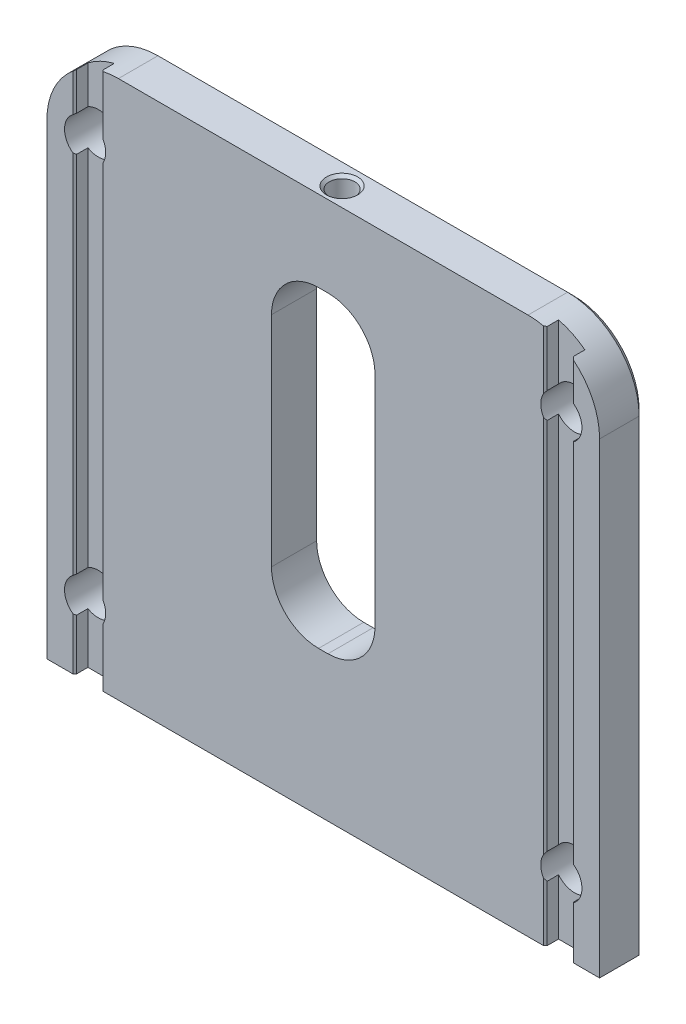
ISO-10303-21;
HEADER;
FILE_DESCRIPTION(('STEP AP214'),'2;1');
FILE_NAME('part.step','',(''),(''),'','','');
FILE_SCHEMA(('AUTOMOTIVE_DESIGN { 1 0 10303 214 1 1 1 1 }'));
ENDSEC;
DATA;
#1=APPLICATION_CONTEXT('core data for automotive mechanical design processes');
#2=APPLICATION_PROTOCOL_DEFINITION('international standard','automotive_design',2000,#1);
#3=PRODUCT_CONTEXT('',#1,'mechanical');
#4=PRODUCT('Part','Part','',(#3));
#5=PRODUCT_RELATED_PRODUCT_CATEGORY('part','',(#4));
#6=PRODUCT_DEFINITION_FORMATION('','',#4);
#7=PRODUCT_DEFINITION_CONTEXT('part definition',#1,'design');
#8=PRODUCT_DEFINITION('design','',#6,#7);
#9=PRODUCT_DEFINITION_SHAPE('','',#8);
#10=(LENGTH_UNIT() NAMED_UNIT(*) SI_UNIT(.MILLI.,.METRE.));
#11=(NAMED_UNIT(*) PLANE_ANGLE_UNIT() SI_UNIT($,.RADIAN.));
#12=(NAMED_UNIT(*) SI_UNIT($,.STERADIAN.) SOLID_ANGLE_UNIT());
#13=UNCERTAINTY_MEASURE_WITH_UNIT(LENGTH_MEASURE(1.E-05),#10,'distance_accuracy_value','');
#14=(GEOMETRIC_REPRESENTATION_CONTEXT(3) GLOBAL_UNCERTAINTY_ASSIGNED_CONTEXT((#13)) GLOBAL_UNIT_ASSIGNED_CONTEXT((#10,
#11,#12)) REPRESENTATION_CONTEXT('',''));
#15=CARTESIAN_POINT('',(0.,0.,0.));
#16=DIRECTION('',(0.,0.,1.));
#17=DIRECTION('',(1.,0.,0.));
#18=AXIS2_PLACEMENT_3D('',#15,#16,#17);
#19=CARTESIAN_POINT('',(-6.731,61.976,-178.064598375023));
#20=DIRECTION('',(0.,-1.,0.));
#21=DIRECTION('',(0.,0.,-1.));
#22=AXIS2_PLACEMENT_3D('',#19,#20,#21);
#23=PLANE('',#22);
#24=DIRECTION('',(0.,0.,1.));
#25=VECTOR('',#24,1.);
#26=CARTESIAN_POINT('',(0.635,61.976,-16.256));
#27=LINE('',#26,#25);
#28=CARTESIAN_POINT('',(0.635,61.976,-17.1897637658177));
#29=VERTEX_POINT('',#28);
#30=CARTESIAN_POINT('',(0.635,61.976,-16.812359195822));
#31=VERTEX_POINT('',#30);
#32=EDGE_CURVE('E642',#29,#31,#27,.T.);
#33=ORIENTED_EDGE('',*,*,#32,.T.);
#34=CARTESIAN_POINT('',(0.,61.976,-18.796));
#35=DIRECTION('',(0.,-1.,0.));
#36=DIRECTION('',(0.,0.,-1.));
#37=AXIS2_PLACEMENT_3D('',#34,#35,#36);
#38=CIRCLE('',#37,2.0828);
#39=CARTESIAN_POINT('',(-0.635,61.976,-16.812359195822));
#40=VERTEX_POINT('',#39);
#41=EDGE_CURVE('E684',#31,#40,#38,.T.);
#42=ORIENTED_EDGE('',*,*,#41,.T.);
#43=DIRECTION('',(0.,0.,1.));
#44=VECTOR('',#43,1.);
#45=CARTESIAN_POINT('',(-0.635,61.976,-22.352));
#46=LINE('',#45,#44);
#47=CARTESIAN_POINT('',(-0.635,61.976,-17.1897637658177));
#48=VERTEX_POINT('',#47);
#49=EDGE_CURVE('E573',#40,#48,#46,.F.);
#50=ORIENTED_EDGE('',*,*,#49,.T.);
#51=CARTESIAN_POINT('',(0.,61.976,-18.796));
#52=DIRECTION('',(0.,-1.,0.));
#53=DIRECTION('',(0.,0.,-1.));
#54=AXIS2_PLACEMENT_3D('',#51,#52,#53);
#55=CIRCLE('',#54,1.7272);
#56=EDGE_CURVE('E639',#48,#29,#55,.F.);
#57=ORIENTED_EDGE('',*,*,#56,.T.);
#58=EDGE_LOOP('',(#33,#42,#50,#57));
#59=FACE_BOUND('',#58,.T.);
#60=ADVANCED_FACE('F15',(#59),#23,.T.);
#61=DIRECTION('',(0.,0.,1.));
#62=VECTOR('',#61,1.);
#63=CARTESIAN_POINT('',(-0.635,61.976,-22.352));
#64=LINE('',#63,#62);
#65=CARTESIAN_POINT('',(-0.635,61.976,-20.4022362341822));
#66=VERTEX_POINT('',#65);
#67=CARTESIAN_POINT('',(-0.635,61.976,-20.779640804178));
#68=VERTEX_POINT('',#67);
#69=EDGE_CURVE('E600',#66,#68,#64,.F.);
#70=ORIENTED_EDGE('',*,*,#69,.T.);
#71=CARTESIAN_POINT('',(0.,61.976,-18.796));
#72=DIRECTION('',(0.,-1.,0.));
#73=DIRECTION('',(0.,0.,-1.));
#74=AXIS2_PLACEMENT_3D('',#71,#72,#73);
#75=CIRCLE('',#74,2.0828);
#76=CARTESIAN_POINT('',(0.635,61.976,-20.779640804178));
#77=VERTEX_POINT('',#76);
#78=EDGE_CURVE('E705',#68,#77,#75,.T.);
#79=ORIENTED_EDGE('',*,*,#78,.T.);
#80=DIRECTION('',(0.,0.,1.));
#81=VECTOR('',#80,1.);
#82=CARTESIAN_POINT('',(0.635,61.976,-16.256));
#83=LINE('',#82,#81);
#84=CARTESIAN_POINT('',(0.635,61.976,-20.4022362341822));
#85=VERTEX_POINT('',#84);
#86=EDGE_CURVE('E726',#77,#85,#83,.T.);
#87=ORIENTED_EDGE('',*,*,#86,.T.);
#88=CARTESIAN_POINT('',(0.,61.976,-18.796));
#89=DIRECTION('',(0.,-1.,0.));
#90=DIRECTION('',(0.,0.,-1.));
#91=AXIS2_PLACEMENT_3D('',#88,#89,#90);
#92=CIRCLE('',#91,1.7272);
#93=EDGE_CURVE('E724',#85,#66,#92,.F.);
#94=ORIENTED_EDGE('',*,*,#93,.T.);
#95=EDGE_LOOP('',(#70,#79,#87,#94));
#96=FACE_BOUND('',#95,.T.);
#97=ADVANCED_FACE('F650',(#96),#23,.T.);
#98=CARTESIAN_POINT('',(0.635,55.626,-178.064598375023));
#99=DIRECTION('',(0.,0.,-1.));
#100=DIRECTION('',(-1.,0.,0.));
#101=AXIS2_PLACEMENT_3D('',#98,#99,#100);
#102=CYLINDRICAL_SURFACE('',#101,6.35);
#103=CARTESIAN_POINT('',(0.635,61.976,-16.812359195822));
#104=CARTESIAN_POINT('',(0.69008338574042,61.9760034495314,-16.8299914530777));
#105=CARTESIAN_POINT('',(0.744401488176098,61.9752826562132,-16.849911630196));
#106=CARTESIAN_POINT('',(0.851154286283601,61.9725439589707,-16.8941765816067));
#107=CARTESIAN_POINT('',(0.903589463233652,61.970526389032,-16.9185202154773));
#108=CARTESIAN_POINT('',(1.05730986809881,61.9627686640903,-16.9978337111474));
#109=CARTESIAN_POINT('',(1.15530731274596,61.95532188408,-17.0591818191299));
#110=CARTESIAN_POINT('',(1.33955738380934,61.9374734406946,-17.1969714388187));
#111=CARTESIAN_POINT('',(1.42581564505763,61.927073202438,-17.2734056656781));
#112=CARTESIAN_POINT('',(1.58454600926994,61.9051152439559,-17.439367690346));
#113=CARTESIAN_POINT('',(1.65701363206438,61.8935571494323,-17.5288997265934));
#114=CARTESIAN_POINT('',(1.78764917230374,61.8708704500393,-17.7207664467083));
#115=CARTESIAN_POINT('',(1.8454766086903,61.8597563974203,-17.8233347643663));
#116=CARTESIAN_POINT('',(1.94309819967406,61.8400056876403,-18.0369249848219));
#117=CARTESIAN_POINT('',(1.9829015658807,61.8313677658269,-18.1479425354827));
#118=CARTESIAN_POINT('',(2.03609087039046,61.8195467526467,-18.3482937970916));
#119=CARTESIAN_POINT('',(2.05350162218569,61.815556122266,-18.4365324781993));
#120=CARTESIAN_POINT('',(2.07682999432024,61.8101459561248,-18.6145571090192));
#121=CARTESIAN_POINT('',(2.08275191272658,61.80872545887,-18.7043424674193));
#122=CARTESIAN_POINT('',(2.0827992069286,61.8087483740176,-18.7941824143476));
#123=B_SPLINE_CURVE_WITH_KNOTS('',3,(#103,#104,#105,#106,#107,#108,#109,#110,#111,#112,#113,
#114,#115,#116,#117,#118,#119,#120,#121,#122),.UNSPECIFIED.,.F.,.F.,(4,2,2,2,2,2,2,2,2,4),(0.,
0.173395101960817,0.346745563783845,0.692521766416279,1.03813140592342,1.38385313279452,
1.73699872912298,2.08996363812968,2.35929463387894,2.62852485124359),.UNSPECIFIED.);
#124=CARTESIAN_POINT('',(2.0827992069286,61.8087483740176,-18.7941824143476));
#125=VERTEX_POINT('',#124);
#126=EDGE_CURVE('E683',#31,#125,#123,.T.);
#127=ORIENTED_EDGE('',*,*,#126,.F.);
#128=ORIENTED_EDGE('',*,*,#32,.F.);
#129=CARTESIAN_POINT('',(0.635,61.976,-20.4022362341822));
#130=CARTESIAN_POINT('',(0.679871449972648,61.9760021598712,-20.3844973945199));
#131=CARTESIAN_POINT('',(0.723975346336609,61.9755240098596,-20.3648858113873));
#132=CARTESIAN_POINT('',(0.810368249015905,61.9737246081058,-20.3220566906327));
#133=CARTESIAN_POINT('',(0.852657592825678,61.9724035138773,-20.2988398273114));
#134=CARTESIAN_POINT('',(0.976224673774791,61.967359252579,-20.2240910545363));
#135=CARTESIAN_POINT('',(1.05440440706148,61.9625540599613,-20.1673804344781));
#136=CARTESIAN_POINT('',(1.20012297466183,61.9512272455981,-20.0418672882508));
#137=CARTESIAN_POINT('',(1.26766290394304,61.9447058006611,-19.9730660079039));
#138=CARTESIAN_POINT('',(1.39037849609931,61.9312136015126,-19.8252193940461));
#139=CARTESIAN_POINT('',(1.44555311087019,61.9242428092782,-19.7461731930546));
#140=CARTESIAN_POINT('',(1.54261923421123,61.9109954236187,-19.5789473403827));
#141=CARTESIAN_POINT('',(1.58434050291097,61.904728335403,-19.4906680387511));
#142=CARTESIAN_POINT('',(1.65236334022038,61.8940671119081,-19.3082402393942));
#143=CARTESIAN_POINT('',(1.67866475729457,61.8896729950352,-19.2140916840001));
#144=CARTESIAN_POINT('',(1.71491969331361,61.8835245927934,-19.0232488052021));
#145=CARTESIAN_POINT('',(1.7249789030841,61.8817532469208,-18.9265751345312));
#146=CARTESIAN_POINT('',(1.72876192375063,61.8810930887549,-18.7329056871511));
#147=CARTESIAN_POINT('',(1.72248730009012,61.8822040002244,-18.6359099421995));
#148=CARTESIAN_POINT('',(1.69396871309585,61.8870931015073,-18.4454935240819));
#149=CARTESIAN_POINT('',(1.67190566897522,61.8908410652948,-18.3520448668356));
#150=CARTESIAN_POINT('',(1.61267400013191,61.9003562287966,-18.1701814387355));
#151=CARTESIAN_POINT('',(1.57550551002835,61.9061234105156,-18.0817666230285));
#152=CARTESIAN_POINT('',(1.48674868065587,61.9187770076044,-17.9116467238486));
#153=CARTESIAN_POINT('',(1.43504291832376,61.9256723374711,-17.830003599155));
#154=CARTESIAN_POINT('',(1.3187184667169,61.9393547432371,-17.6764083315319));
#155=CARTESIAN_POINT('',(1.25409184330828,61.946141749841,-17.6044621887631));
#156=CARTESIAN_POINT('',(1.11290571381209,61.9583914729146,-17.4715482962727));
#157=CARTESIAN_POINT('',(1.03622058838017,61.9638384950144,-17.4107126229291));
#158=CARTESIAN_POINT('',(0.873708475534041,61.9720288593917,-17.3029110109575));
#159=CARTESIAN_POINT('',(0.787905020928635,61.9747789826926,-17.255910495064));
#160=CARTESIAN_POINT('',(0.677753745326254,61.9758921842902,-17.2071608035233));
#161=CARTESIAN_POINT('',(0.656458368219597,61.9760015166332,-17.1982436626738));
#162=CARTESIAN_POINT('',(0.635,61.976,-17.1897637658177));
#163=B_SPLINE_CURVE_WITH_KNOTS('',3,(#129,#130,#131,#132,#133,#134,#135,#136,#137,#138,#139,
#140,#141,#142,#143,#144,#145,#146,#147,#148,#149,#150,#151,#152,#153,#154,#155,#156,#157,#158,
#159,#160,#161,#162),.UNSPECIFIED.,.F.,.F.,(4,2,2,2,2,2,2,2,2,2,2,2,2,2,2,2,4),(0.,
0.144657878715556,0.289288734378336,0.57790393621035,0.866489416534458,1.1550993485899,
1.44722980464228,1.7393631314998,2.02958772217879,2.31978449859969,2.60670809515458,
2.89362913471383,3.18293783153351,3.47242472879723,3.76515602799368,4.05714938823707,
4.12638972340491),.UNSPECIFIED.);
#164=EDGE_CURVE('E630',#85,#29,#163,.T.);
#165=ORIENTED_EDGE('',*,*,#164,.F.);
#166=ORIENTED_EDGE('',*,*,#86,.F.);
#167=CARTESIAN_POINT('',(2.0828,61.8087481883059,-18.796));
#168=CARTESIAN_POINT('',(2.08280054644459,61.8087432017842,-18.8538939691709));
#169=CARTESIAN_POINT('',(2.08038462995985,61.8093143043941,-18.9117592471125));
#170=CARTESIAN_POINT('',(2.07075271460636,61.8115598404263,-19.0270578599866));
#171=CARTESIAN_POINT('',(2.06353751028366,61.8132340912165,-19.0844912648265));
#172=CARTESIAN_POINT('',(2.03479195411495,61.8198269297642,-19.2553080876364));
#173=CARTESIAN_POINT('',(2.00616125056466,61.8263161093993,-19.3675192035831));
#174=CARTESIAN_POINT('',(1.93086713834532,61.8424853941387,-19.5853741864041));
#175=CARTESIAN_POINT('',(1.88420618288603,61.852165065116,-19.6910189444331));
#176=CARTESIAN_POINT('',(1.7741766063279,61.8732317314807,-19.8930801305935));
#177=CARTESIAN_POINT('',(1.71080251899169,61.8846192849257,-19.9894935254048));
#178=CARTESIAN_POINT('',(1.56780007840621,61.9075368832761,-20.1721353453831));
#179=CARTESIAN_POINT('',(1.4879083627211,61.9190659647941,-20.2581576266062));
#180=CARTESIAN_POINT('',(1.31469470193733,61.9401196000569,-20.415666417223));
#181=CARTESIAN_POINT('',(1.22138029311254,61.9496452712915,-20.487161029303));
#182=CARTESIAN_POINT('',(1.04686523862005,61.963083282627,-20.5988377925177));
#183=CARTESIAN_POINT('',(0.967890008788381,61.9677857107,-20.6424355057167));
#184=CARTESIAN_POINT('',(0.804897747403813,61.9742578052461,-20.7191064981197));
#185=CARTESIAN_POINT('',(0.720881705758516,61.9760280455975,-20.7521818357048));
#186=CARTESIAN_POINT('',(0.634999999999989,61.976,-20.779640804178));
#187=B_SPLINE_CURVE_WITH_KNOTS('',3,(#167,#168,#169,#170,#171,#172,#173,#174,#175,#176,#177,
#178,#179,#180,#181,#182,#183,#184,#185,#186),.UNSPECIFIED.,.F.,.F.,(4,2,2,2,2,2,2,2,2,4),(0.,
0.173572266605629,0.347115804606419,0.69328177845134,1.03940066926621,1.38563290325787,
1.73788280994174,2.08993570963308,2.36016289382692,2.63033718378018),.UNSPECIFIED.);
#188=CARTESIAN_POINT('',(2.0828,61.8087481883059,-18.796));
#189=VERTEX_POINT('',#188);
#190=EDGE_CURVE('E676',#189,#77,#187,.T.);
#191=ORIENTED_EDGE('',*,*,#190,.F.);
#192=CARTESIAN_POINT('',(0.635,55.626,-18.796));
#193=DIRECTION('',(0.,0.,1.));
#194=DIRECTION('',(1.,0.,0.));
#195=AXIS2_PLACEMENT_3D('',#192,#193,#194);
#196=CIRCLE('',#195,6.35);
#197=CARTESIAN_POINT('',(2.083054,61.8086887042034,-18.796));
#198=VERTEX_POINT('',#197);
#199=EDGE_CURVE('E957',#198,#189,#196,.T.);
#200=ORIENTED_EDGE('',*,*,#199,.F.);
#201=CARTESIAN_POINT('',(2.083054,61.8086887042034,-18.796));
#202=CARTESIAN_POINT('',(2.08305454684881,61.8086837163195,-18.8539007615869));
#203=CARTESIAN_POINT('',(2.08063835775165,61.80925498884,-18.9117728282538));
#204=CARTESIAN_POINT('',(2.07100535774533,61.8115011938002,-19.0270849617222));
#205=CARTESIAN_POINT('',(2.06378934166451,61.8131759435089,-19.0845250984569));
#206=CARTESIAN_POINT('',(2.03504056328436,61.8197707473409,-19.2553618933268));
#207=CARTESIAN_POINT('',(2.00640666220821,61.8262618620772,-19.3675861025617));
#208=CARTESIAN_POINT('',(1.93110419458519,61.8424360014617,-19.5854664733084));
#209=CARTESIAN_POINT('',(1.88443808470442,61.8521185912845,-19.691123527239));
#210=CARTESIAN_POINT('',(1.77439639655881,61.8731917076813,-19.893208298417));
#211=CARTESIAN_POINT('',(1.71101534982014,61.8845827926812,-19.9896329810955));
#212=CARTESIAN_POINT('',(1.5679967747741,61.9075077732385,-20.1722968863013));
#213=CARTESIAN_POINT('',(1.48809576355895,61.9190407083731,-20.2583298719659));
#214=CARTESIAN_POINT('',(1.31486181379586,61.9401017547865,-20.4158584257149));
#215=CARTESIAN_POINT('',(1.22153641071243,61.94963098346,-20.4873620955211));
#216=CARTESIAN_POINT('',(1.04698802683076,61.963075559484,-20.5990612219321));
#217=CARTESIAN_POINT('',(0.967989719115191,61.9677807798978,-20.6426710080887));
#218=CARTESIAN_POINT('',(0.804949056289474,61.974256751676,-20.7193613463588));
#219=CARTESIAN_POINT('',(0.720907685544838,61.9760280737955,-20.7524439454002));
#220=CARTESIAN_POINT('',(0.634999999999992,61.976,-20.7799074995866));
#221=B_SPLINE_CURVE_WITH_KNOTS('',3,(#201,#202,#203,#204,#205,#206,#207,#208,#209,#210,#211,
#212,#213,#214,#215,#216,#217,#218,#219,#220),.UNSPECIFIED.,.F.,.F.,(4,2,2,2,2,2,2,2,2,4),(0.,
0.173592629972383,0.347156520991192,0.693362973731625,1.03952227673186,1.38579497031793,
1.73808811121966,2.09018426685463,2.3604893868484,2.63074191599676),.UNSPECIFIED.);
#222=CARTESIAN_POINT('',(0.635,61.976,-20.7799074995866));
#223=VERTEX_POINT('',#222);
#224=EDGE_CURVE('E661',#198,#223,#221,.T.);
#225=ORIENTED_EDGE('',*,*,#224,.T.);
#226=CARTESIAN_POINT('',(0.635,61.976,-22.352));
#227=VERTEX_POINT('',#226);
#228=EDGE_CURVE('E586',#227,#223,#83,.T.);
#229=ORIENTED_EDGE('',*,*,#228,.F.);
#230=CARTESIAN_POINT('',(0.635,55.626,-22.352));
#231=DIRECTION('',(0.,0.,-1.));
#232=DIRECTION('',(-1.,0.,0.));
#233=AXIS2_PLACEMENT_3D('',#230,#231,#232);
#234=CIRCLE('',#233,6.35);
#235=CARTESIAN_POINT('',(6.985,55.626,-22.352));
#236=VERTEX_POINT('',#235);
#237=EDGE_CURVE('E577',#236,#227,#234,.F.);
#238=ORIENTED_EDGE('',*,*,#237,.F.);
#239=DIRECTION('',(0.,0.,1.));
#240=VECTOR('',#239,1.);
#241=CARTESIAN_POINT('',(6.985,55.626,-22.352));
#242=LINE('',#241,#240);
#243=CARTESIAN_POINT('',(6.985,55.626,-16.256));
#244=VERTEX_POINT('',#243);
#245=EDGE_CURVE('E752',#244,#236,#242,.F.);
#246=ORIENTED_EDGE('',*,*,#245,.F.);
#247=CARTESIAN_POINT('',(0.635,55.626,-16.256));
#248=DIRECTION('',(0.,0.,1.));
#249=DIRECTION('',(1.,0.,0.));
#250=AXIS2_PLACEMENT_3D('',#247,#248,#249);
#251=CIRCLE('',#250,6.35);
#252=CARTESIAN_POINT('',(0.635,61.976,-16.256));
#253=VERTEX_POINT('',#252);
#254=EDGE_CURVE('E986',#253,#244,#251,.F.);
#255=ORIENTED_EDGE('',*,*,#254,.F.);
#256=CARTESIAN_POINT('',(0.635,61.976,-16.8120925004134));
#257=VERTEX_POINT('',#256);
#258=EDGE_CURVE('E572',#257,#253,#27,.T.);
#259=ORIENTED_EDGE('',*,*,#258,.F.);
#260=CARTESIAN_POINT('',(0.635,61.976,-16.8120925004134));
#261=CARTESIAN_POINT('',(0.690090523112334,61.9760034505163,-16.8297246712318));
#262=CARTESIAN_POINT('',(0.744415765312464,61.9752824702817,-16.8496450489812));
#263=CARTESIAN_POINT('',(0.851182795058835,61.9725430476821,-16.8939109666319));
#264=CARTESIAN_POINT('',(0.903625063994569,61.970524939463,-16.9182553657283));
#265=CARTESIAN_POINT('',(1.05736653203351,61.9627651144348,-16.9975719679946));
#266=CARTESIAN_POINT('',(1.15537781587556,61.9553162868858,-17.0589232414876));
#267=CARTESIAN_POINT('',(1.33965479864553,61.937462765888,-17.1967212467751));
#268=CARTESIAN_POINT('',(1.42592613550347,61.9270594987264,-17.2731606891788));
#269=CARTESIAN_POINT('',(1.58468168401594,61.9050948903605,-17.4391350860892));
#270=CARTESIAN_POINT('',(1.65716141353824,61.8935331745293,-17.5286742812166));
#271=CARTESIAN_POINT('',(1.78782065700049,61.870838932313,-17.7205579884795));
#272=CARTESIAN_POINT('',(1.8456595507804,61.8597209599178,-17.823136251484));
#273=CARTESIAN_POINT('',(1.9433022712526,61.8399628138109,-18.0367482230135));
#274=CARTESIAN_POINT('',(1.98311530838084,61.8313213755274,-18.1477775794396));
#275=CARTESIAN_POINT('',(2.03632360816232,61.8194941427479,-18.3481654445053));
#276=CARTESIAN_POINT('',(2.0537422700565,61.8155009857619,-18.4364290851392));
#277=CARTESIAN_POINT('',(2.0770812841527,61.8100873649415,-18.6145047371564));
#278=CARTESIAN_POINT('',(2.0830059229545,61.8086659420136,-18.7043161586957));
#279=CARTESIAN_POINT('',(2.08305320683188,61.8086888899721,-18.7941821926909));
#280=B_SPLINE_CURVE_WITH_KNOTS('',3,(#260,#261,#262,#263,#264,#265,#266,#267,#268,#269,#270,
#271,#272,#273,#274,#275,#276,#277,#278,#279),.UNSPECIFIED.,.F.,.F.,(4,2,2,2,2,2,2,2,2,4),(0.,
0.173415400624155,0.346786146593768,0.692602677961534,1.03825254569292,1.38401455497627,
1.73720373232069,2.09021224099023,2.35962104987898,2.62892936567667),.UNSPECIFIED.);
#281=CARTESIAN_POINT('',(2.08305320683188,61.8086888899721,-18.7941821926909));
#282=VERTEX_POINT('',#281);
#283=EDGE_CURVE('E669',#257,#282,#280,.T.);
#284=ORIENTED_EDGE('',*,*,#283,.T.);
#285=CARTESIAN_POINT('',(0.635,55.626,-18.7954458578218));
#286=DIRECTION('',(-0.000872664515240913,0.,0.99999961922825));
#287=DIRECTION('',(-0.99999961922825,0.,-0.000872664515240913));
#288=AXIS2_PLACEMENT_3D('',#285,#286,#287);
#289=ELLIPSE('',#288,6.35000241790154,6.35);
#290=EDGE_CURVE('E424',#125,#282,#289,.F.);
#291=ORIENTED_EDGE('',*,*,#290,.F.);
#292=EDGE_LOOP('',(#127,#128,#165,#166,#191,#200,#225,#229,#238,#246,#255,#259,#284,#291));
#293=FACE_BOUND('',#292,.T.);
#294=ADVANCED_FACE('F644',(#293),#102,.F.);
#295=CARTESIAN_POINT('',(-0.635,55.626,-178.064598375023));
#296=DIRECTION('',(0.,0.,-1.));
#297=DIRECTION('',(-1.,0.,0.));
#298=AXIS2_PLACEMENT_3D('',#295,#296,#297);
#299=CYLINDRICAL_SURFACE('',#298,6.35);
#300=CARTESIAN_POINT('',(-0.635,61.976,-20.779640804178));
#301=CARTESIAN_POINT('',(-0.690086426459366,61.9760034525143,-20.7620075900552));
#302=CARTESIAN_POINT('',(-0.744407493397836,61.9752825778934,-20.7420861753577));
#303=CARTESIAN_POINT('',(-0.851165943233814,61.9725435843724,-20.6978182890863));
#304=CARTESIAN_POINT('',(-0.903603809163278,61.9705258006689,-20.6734729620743));
#305=CARTESIAN_POINT('',(-1.05732064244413,61.9627678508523,-20.5941595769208));
#306=CARTESIAN_POINT('',(-1.15531233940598,61.9553214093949,-20.5328145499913));
#307=CARTESIAN_POINT('',(-1.33955807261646,61.9374733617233,-20.3950279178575));
#308=CARTESIAN_POINT('',(-1.42581701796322,61.9270729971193,-20.3185926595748));
#309=CARTESIAN_POINT('',(-1.58454693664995,61.9051151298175,-20.1526315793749));
#310=CARTESIAN_POINT('',(-1.65701362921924,61.8935572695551,-20.0631017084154));
#311=CARTESIAN_POINT('',(-1.78763423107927,61.8708729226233,-19.8712540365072));
#312=CARTESIAN_POINT('',(-1.84545140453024,61.8597608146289,-19.7687049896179));
#313=CARTESIAN_POINT('',(-1.94307761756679,61.8400105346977,-19.5551354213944));
#314=CARTESIAN_POINT('',(-1.98288745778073,61.8313722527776,-19.4441152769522));
#315=CARTESIAN_POINT('',(-2.04307590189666,61.8179930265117,-19.2173906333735));
#316=CARTESIAN_POINT('',(-2.06356739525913,61.8132294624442,-19.101717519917));
#317=CARTESIAN_POINT('',(-2.08482790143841,61.8082830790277,-18.8684885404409));
#318=CARTESIAN_POINT('',(-2.08560078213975,61.8080993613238,-18.7509330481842));
#319=CARTESIAN_POINT('',(-2.06762142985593,61.8122889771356,-18.5201685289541));
#320=CARTESIAN_POINT('',(-2.04932160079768,61.8165567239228,-18.4069219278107));
#321=CARTESIAN_POINT('',(-1.99448396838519,61.8288287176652,-18.185148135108));
#322=CARTESIAN_POINT('',(-1.95794466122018,61.8368332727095,-18.0766213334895));
#323=CARTESIAN_POINT('',(-1.86739334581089,61.8554339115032,-17.8664356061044));
#324=CARTESIAN_POINT('',(-1.813257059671,61.866048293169,-17.7648319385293));
#325=CARTESIAN_POINT('',(-1.68905873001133,61.8882221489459,-17.5719502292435));
#326=CARTESIAN_POINT('',(-1.61899141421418,61.89978193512,-17.4806756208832));
#327=CARTESIAN_POINT('',(-1.46289672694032,61.9223041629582,-17.3087904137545));
#328=CARTESIAN_POINT('',(-1.37652722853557,61.9332456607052,-17.2284876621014));
#329=CARTESIAN_POINT('',(-1.19132791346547,61.9522642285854,-17.0835209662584));
#330=CARTESIAN_POINT('',(-1.09251247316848,61.9603445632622,-17.0188392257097));
#331=CARTESIAN_POINT('',(-0.932429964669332,61.9692839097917,-16.9324642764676));
#332=CARTESIAN_POINT('',(-0.874506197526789,61.9717558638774,-16.9045931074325));
#333=CARTESIAN_POINT('',(-0.756367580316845,61.9751159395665,-16.8543305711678));
#334=CARTESIAN_POINT('',(-0.696155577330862,61.9760059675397,-16.8319326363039));
#335=CARTESIAN_POINT('',(-0.635,61.976,-16.812359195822));
#336=B_SPLINE_CURVE_WITH_KNOTS('',3,(#300,#301,#302,#303,#304,#305,#306,#307,#308,#309,#310,
#311,#312,#313,#314,#315,#316,#317,#318,#319,#320,#321,#322,#323,#324,#325,#326,#327,#328,#329,
#330,#331,#332,#333,#334,#335),.UNSPECIFIED.,.F.,.F.,(4,2,2,2,2,2,2,2,2,2,2,2,2,2,2,2,2,4),(0.,
0.173404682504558,0.346764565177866,0.692521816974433,1.0381339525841,1.38385318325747,
1.73691628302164,2.08996368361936,2.440934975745,2.79183742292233,3.13460186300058,
3.47739456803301,3.82266283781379,4.16804553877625,4.52170219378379,4.87495402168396,
5.06767515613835,5.2601638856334),.UNSPECIFIED.);
#337=EDGE_CURVE('E700',#68,#40,#336,.T.);
#338=ORIENTED_EDGE('',*,*,#337,.F.);
#339=ORIENTED_EDGE('',*,*,#69,.F.);
#340=CARTESIAN_POINT('',(-0.635,61.976,-17.1897637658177));
#341=CARTESIAN_POINT('',(-0.679871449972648,61.9760021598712,-17.2075026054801));
#342=CARTESIAN_POINT('',(-0.723975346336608,61.9755240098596,-17.2271141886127));
#343=CARTESIAN_POINT('',(-0.810368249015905,61.9737246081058,-17.2699433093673));
#344=CARTESIAN_POINT('',(-0.852657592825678,61.9724035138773,-17.2931601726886));
#345=CARTESIAN_POINT('',(-0.976224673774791,61.967359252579,-17.3679089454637));
#346=CARTESIAN_POINT('',(-1.05440440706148,61.9625540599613,-17.4246195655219));
#347=CARTESIAN_POINT('',(-1.20012297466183,61.9512272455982,-17.5501327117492));
#348=CARTESIAN_POINT('',(-1.26766290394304,61.9447058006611,-17.6189339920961));
#349=CARTESIAN_POINT('',(-1.39037849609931,61.9312136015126,-17.7667806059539));
#350=CARTESIAN_POINT('',(-1.44555311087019,61.9242428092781,-17.8458268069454));
#351=CARTESIAN_POINT('',(-1.54261923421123,61.9109954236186,-18.0130526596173));
#352=CARTESIAN_POINT('',(-1.58434050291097,61.904728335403,-18.1013319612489));
#353=CARTESIAN_POINT('',(-1.65236334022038,61.8940671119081,-18.2837597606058));
#354=CARTESIAN_POINT('',(-1.67866475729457,61.8896729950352,-18.3779083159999));
#355=CARTESIAN_POINT('',(-1.71491969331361,61.8835245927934,-18.5687511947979));
#356=CARTESIAN_POINT('',(-1.7249789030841,61.8817532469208,-18.6654248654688));
#357=CARTESIAN_POINT('',(-1.72876192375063,61.8810930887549,-18.8590943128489));
#358=CARTESIAN_POINT('',(-1.72248730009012,61.8822040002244,-18.9560900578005));
#359=CARTESIAN_POINT('',(-1.69396871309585,61.8870931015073,-19.1465064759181));
#360=CARTESIAN_POINT('',(-1.67190566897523,61.8908410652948,-19.2399551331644));
#361=CARTESIAN_POINT('',(-1.61267400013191,61.9003562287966,-19.4218185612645));
#362=CARTESIAN_POINT('',(-1.57550551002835,61.9061234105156,-19.5102333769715));
#363=CARTESIAN_POINT('',(-1.48674868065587,61.9187770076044,-19.6803532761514));
#364=CARTESIAN_POINT('',(-1.43504291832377,61.9256723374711,-19.761996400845));
#365=CARTESIAN_POINT('',(-1.31871846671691,61.9393547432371,-19.9155916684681));
#366=CARTESIAN_POINT('',(-1.25409184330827,61.946141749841,-19.9875378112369));
#367=CARTESIAN_POINT('',(-1.11290571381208,61.9583914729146,-20.1204517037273));
#368=CARTESIAN_POINT('',(-1.03622058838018,61.9638384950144,-20.1812873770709));
#369=CARTESIAN_POINT('',(-0.873708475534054,61.9720288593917,-20.2890889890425));
#370=CARTESIAN_POINT('',(-0.787905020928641,61.9747789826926,-20.336089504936));
#371=CARTESIAN_POINT('',(-0.677753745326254,61.9758921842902,-20.3848391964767));
#372=CARTESIAN_POINT('',(-0.656458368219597,61.9760015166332,-20.3937563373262));
#373=CARTESIAN_POINT('',(-0.635,61.976,-20.4022362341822));
#374=B_SPLINE_CURVE_WITH_KNOTS('',3,(#340,#341,#342,#343,#344,#345,#346,#347,#348,#349,#350,
#351,#352,#353,#354,#355,#356,#357,#358,#359,#360,#361,#362,#363,#364,#365,#366,#367,#368,#369,
#370,#371,#372,#373),.UNSPECIFIED.,.F.,.F.,(4,2,2,2,2,2,2,2,2,2,2,2,2,2,2,2,4),(0.,
0.144657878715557,0.289288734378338,0.577903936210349,0.86648941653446,1.15509934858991,
1.44722980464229,1.73936313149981,2.02958772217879,2.31978449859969,2.60670809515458,
2.89362913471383,3.1829378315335,3.4724247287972,3.76515602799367,4.05714938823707,
4.1263897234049),.UNSPECIFIED.);
#375=EDGE_CURVE('E599',#48,#66,#374,.T.);
#376=ORIENTED_EDGE('',*,*,#375,.F.);
#377=ORIENTED_EDGE('',*,*,#49,.F.);
#378=EDGE_LOOP('',(#338,#339,#376,#377));
#379=FACE_BOUND('',#378,.T.);
#380=ADVANCED_FACE('F649',(#379),#299,.F.);
#381=CARTESIAN_POINT('',(0.,72.898,-18.796));
#382=DIRECTION('',(0.,1.,0.));
#383=DIRECTION('',(0.,0.,1.));
#384=AXIS2_PLACEMENT_3D('',#381,#382,#383);
#385=CONICAL_SURFACE('',#384,2.1082,0.785398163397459);
#386=CARTESIAN_POINT('',(0.,72.898,-18.796));
#387=DIRECTION('',(0.,-1.,0.));
#388=DIRECTION('',(1.,0.,0.));
#389=AXIS2_PLACEMENT_3D('',#386,#387,#388);
#390=CIRCLE('',#389,2.1082);
#391=CARTESIAN_POINT('',(2.1082,72.898,-18.796));
#392=VERTEX_POINT('',#391);
#393=EDGE_CURVE('E431',#392,#392,#390,.T.);
#394=ORIENTED_EDGE('',*,*,#393,.F.);
#395=EDGE_LOOP('',(#394));
#396=FACE_BOUND('',#395,.T.);
#397=CARTESIAN_POINT('',(0.,72.517,-18.796));
#398=DIRECTION('',(0.,-1.,0.));
#399=DIRECTION('',(0.,0.,-1.));
#400=AXIS2_PLACEMENT_3D('',#397,#398,#399);
#401=CIRCLE('',#400,1.7272);
#402=CARTESIAN_POINT('',(0.,72.517,-20.5232));
#403=VERTEX_POINT('',#402);
#404=EDGE_CURVE('E417',#403,#403,#401,.F.);
#405=ORIENTED_EDGE('',*,*,#404,.F.);
#406=EDGE_LOOP('',(#405));
#407=FACE_BOUND('',#406,.T.);
#408=DIRECTION('',(0.707106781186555,0.70710678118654,0.));
#409=VECTOR('',#408,1.);
#410=CARTESIAN_POINT('',(0.,70.7898,-18.796));
#411=LINE('',#410,#409);
#412=CARTESIAN_POINT('',(2.083054,72.872854,-18.796));
#413=VERTEX_POINT('',#412);
#414=CARTESIAN_POINT('',(2.0828,72.8726,-18.796));
#415=VERTEX_POINT('',#414);
#416=EDGE_CURVE('E23',#413,#415,#411,.F.);
#417=ORIENTED_EDGE('',*,*,#416,.T.);
#418=CARTESIAN_POINT('',(0.,72.8726,-18.796));
#419=DIRECTION('',(0.,1.,0.));
#420=DIRECTION('',(0.,0.,1.));
#421=AXIS2_PLACEMENT_3D('',#418,#419,#420);
#422=CIRCLE('',#421,2.0828);
#423=CARTESIAN_POINT('',(2.0827992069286,72.8726,-18.7941824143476));
#424=VERTEX_POINT('',#423);
#425=EDGE_CURVE('E9',#415,#424,#422,.T.);
#426=ORIENTED_EDGE('',*,*,#425,.T.);
#427=DIRECTION('',(0.707106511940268,0.70710678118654,0.000617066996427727));
#428=VECTOR('',#427,1.);
#429=CARTESIAN_POINT('',(0.,70.7898,-18.796));
#430=LINE('',#429,#428);
#431=CARTESIAN_POINT('',(2.08305320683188,72.872854,-18.7941821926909));
#432=VERTEX_POINT('',#431);
#433=EDGE_CURVE('E416',#424,#432,#430,.T.);
#434=ORIENTED_EDGE('',*,*,#433,.T.);
#435=CARTESIAN_POINT('',(0.,72.872854,-18.796));
#436=DIRECTION('',(0.,1.,0.));
#437=DIRECTION('',(0.,0.,1.));
#438=AXIS2_PLACEMENT_3D('',#435,#436,#437);
#439=CIRCLE('',#438,2.083054);
#440=EDGE_CURVE('E408',#413,#432,#439,.T.);
#441=ORIENTED_EDGE('',*,*,#440,.F.);
#442=EDGE_LOOP('',(#417,#426,#434,#441));
#443=FACE_BOUND('',#442,.T.);
#444=ADVANCED_FACE('F426',(#396,#407,#443),#385,.F.);
#445=CARTESIAN_POINT('',(33.528,72.898,-16.256));
#446=DIRECTION('',(0.,-1.,0.));
#447=DIRECTION('',(1.,0.,0.));
#448=AXIS2_PLACEMENT_3D('',#445,#446,#447);
#449=PLANE('',#448);
#450=ORIENTED_EDGE('',*,*,#393,.T.);
#451=EDGE_LOOP('',(#450));
#452=FACE_BOUND('',#451,.T.);
#453=DIRECTION('',(0.,0.,-1.));
#454=VECTOR('',#453,1.);
#455=CARTESIAN_POINT('',(27.6352,72.898,-22.352));
#456=LINE('',#455,#454);
#457=CARTESIAN_POINT('',(27.6352,72.898,-16.256));
#458=VERTEX_POINT('',#457);
#459=CARTESIAN_POINT('',(27.6352,72.898,-21.59));
#460=VERTEX_POINT('',#459);
#461=EDGE_CURVE('E886',#458,#460,#456,.T.);
#462=ORIENTED_EDGE('',*,*,#461,.T.);
#463=DIRECTION('',(-1.,0.,0.));
#464=VECTOR('',#463,1.);
#465=CARTESIAN_POINT('',(-27.6352,72.898,-21.59));
#466=LINE('',#465,#464);
#467=CARTESIAN_POINT('',(-27.6352,72.898,-21.59));
#468=VERTEX_POINT('',#467);
#469=EDGE_CURVE('E550',#460,#468,#466,.T.);
#470=ORIENTED_EDGE('',*,*,#469,.T.);
#471=DIRECTION('',(0.,0.,-1.));
#472=VECTOR('',#471,1.);
#473=CARTESIAN_POINT('',(-27.6352,72.898,-16.256));
#474=LINE('',#473,#472);
#475=CARTESIAN_POINT('',(-27.6352,72.898,-16.256));
#476=VERTEX_POINT('',#475);
#477=EDGE_CURVE('E884',#468,#476,#474,.F.);
#478=ORIENTED_EDGE('',*,*,#477,.T.);
#479=DIRECTION('',(-1.,0.,0.));
#480=VECTOR('',#479,1.);
#481=CARTESIAN_POINT('',(28.5496,72.898,-16.256));
#482=LINE('',#481,#480);
#483=EDGE_CURVE('E907',#458,#476,#482,.T.);
#484=ORIENTED_EDGE('',*,*,#483,.F.);
#485=EDGE_LOOP('',(#462,#470,#478,#484));
#486=FACE_BOUND('',#485,.T.);
#487=ADVANCED_FACE('F1042',(#452,#486),#449,.F.);
#488=CARTESIAN_POINT('',(-37.2872,72.898,-22.352));
#489=DIRECTION('',(0.,0.,-1.));
#490=DIRECTION('',(-1.,0.,0.));
#491=AXIS2_PLACEMENT_3D('',#488,#489,#490);
#492=PLANE('',#491);
#493=DIRECTION('',(1.,0.,0.));
#494=VECTOR('',#493,1.);
#495=CARTESIAN_POINT('',(27.6352,72.136,-22.352));
#496=LINE('',#495,#494);
#497=CARTESIAN_POINT('',(-27.6352,72.136,-22.352));
#498=VERTEX_POINT('',#497);
#499=CARTESIAN_POINT('',(27.6352,72.136,-22.352));
#500=VERTEX_POINT('',#499);
#501=EDGE_CURVE('E558',#498,#500,#496,.T.);
#502=ORIENTED_EDGE('',*,*,#501,.T.);
#503=CARTESIAN_POINT('',(27.6352,63.246,-22.352));
#504=DIRECTION('',(0.,0.,-1.));
#505=DIRECTION('',(-1.,0.,0.));
#506=AXIS2_PLACEMENT_3D('',#503,#504,#505);
#507=CIRCLE('',#506,8.89);
#508=CARTESIAN_POINT('',(36.5252,63.246,-22.352));
#509=VERTEX_POINT('',#508);
#510=EDGE_CURVE('E555',#500,#509,#507,.T.);
#511=ORIENTED_EDGE('',*,*,#510,.T.);
#512=DIRECTION('',(0.,-1.,0.));
#513=VECTOR('',#512,1.);
#514=CARTESIAN_POINT('',(36.5252,72.898,-22.352));
#515=LINE('',#514,#513);
#516=CARTESIAN_POINT('',(36.5252,1.016,-22.352));
#517=VERTEX_POINT('',#516);
#518=EDGE_CURVE('E566',#509,#517,#515,.T.);
#519=ORIENTED_EDGE('',*,*,#518,.T.);
#520=DIRECTION('',(-1.,0.,0.));
#521=VECTOR('',#520,1.);
#522=CARTESIAN_POINT('',(-37.2872,1.01599999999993,-22.352));
#523=LINE('',#522,#521);
#524=CARTESIAN_POINT('',(-36.5252,1.01599999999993,-22.352));
#525=VERTEX_POINT('',#524);
#526=EDGE_CURVE('E564',#517,#525,#523,.T.);
#527=ORIENTED_EDGE('',*,*,#526,.T.);
#528=DIRECTION('',(0.,1.,0.));
#529=VECTOR('',#528,1.);
#530=CARTESIAN_POINT('',(-36.5252,72.898,-22.352));
#531=LINE('',#530,#529);
#532=CARTESIAN_POINT('',(-36.5252,63.246,-22.352));
#533=VERTEX_POINT('',#532);
#534=EDGE_CURVE('E562',#525,#533,#531,.T.);
#535=ORIENTED_EDGE('',*,*,#534,.T.);
#536=CARTESIAN_POINT('',(-27.6352,63.246,-22.352));
#537=DIRECTION('',(0.,0.,-1.));
#538=DIRECTION('',(-1.,0.,0.));
#539=AXIS2_PLACEMENT_3D('',#536,#537,#538);
#540=CIRCLE('',#539,8.89);
#541=EDGE_CURVE('E560',#533,#498,#540,.T.);
#542=ORIENTED_EDGE('',*,*,#541,.T.);
#543=EDGE_LOOP('',(#502,#511,#519,#527,#535,#542));
#544=FACE_BOUND('',#543,.T.);
#545=DIRECTION('',(0.,1.,0.));
#546=VECTOR('',#545,1.);
#547=CARTESIAN_POINT('',(6.985,72.898,-22.352));
#548=LINE('',#547,#546);
#549=CARTESIAN_POINT('',(6.985,26.162,-22.352));
#550=VERTEX_POINT('',#549);
#551=EDGE_CURVE('E738',#550,#236,#548,.T.);
#552=ORIENTED_EDGE('',*,*,#551,.T.);
#553=ORIENTED_EDGE('',*,*,#237,.T.);
#554=DIRECTION('',(-1.,0.,0.));
#555=VECTOR('',#554,1.);
#556=CARTESIAN_POINT('',(-37.2872,61.976,-22.352));
#557=LINE('',#556,#555);
#558=CARTESIAN_POINT('',(-0.635,61.976,-22.352));
#559=VERTEX_POINT('',#558);
#560=EDGE_CURVE('E597',#227,#559,#557,.T.);
#561=ORIENTED_EDGE('',*,*,#560,.T.);
#562=CARTESIAN_POINT('',(-0.635,55.626,-22.352));
#563=DIRECTION('',(0.,0.,-1.));
#564=DIRECTION('',(-1.,0.,0.));
#565=AXIS2_PLACEMENT_3D('',#562,#563,#564);
#566=CIRCLE('',#565,6.35);
#567=CARTESIAN_POINT('',(-6.985,55.626,-22.352));
#568=VERTEX_POINT('',#567);
#569=EDGE_CURVE('E576',#559,#568,#566,.F.);
#570=ORIENTED_EDGE('',*,*,#569,.T.);
#571=DIRECTION('',(0.,-1.,0.));
#572=VECTOR('',#571,1.);
#573=CARTESIAN_POINT('',(-6.985,72.898,-22.352));
#574=LINE('',#573,#572);
#575=CARTESIAN_POINT('',(-6.985,26.162,-22.352));
#576=VERTEX_POINT('',#575);
#577=EDGE_CURVE('E593',#568,#576,#574,.T.);
#578=ORIENTED_EDGE('',*,*,#577,.T.);
#579=CARTESIAN_POINT('',(-0.635,26.162,-22.352));
#580=DIRECTION('',(0.,0.,-1.));
#581=DIRECTION('',(-1.,0.,0.));
#582=AXIS2_PLACEMENT_3D('',#579,#580,#581);
#583=CIRCLE('',#582,6.35);
#584=CARTESIAN_POINT('',(-0.635,19.812,-22.352));
#585=VERTEX_POINT('',#584);
#586=EDGE_CURVE('E585',#576,#585,#583,.F.);
#587=ORIENTED_EDGE('',*,*,#586,.T.);
#588=DIRECTION('',(1.,0.,0.));
#589=VECTOR('',#588,1.);
#590=CARTESIAN_POINT('',(-37.2872,19.812,-22.352));
#591=LINE('',#590,#589);
#592=CARTESIAN_POINT('',(0.635,19.812,-22.352));
#593=VERTEX_POINT('',#592);
#594=EDGE_CURVE('E739',#585,#593,#591,.T.);
#595=ORIENTED_EDGE('',*,*,#594,.T.);
#596=CARTESIAN_POINT('',(0.635,26.162,-22.352));
#597=DIRECTION('',(0.,0.,-1.));
#598=DIRECTION('',(-1.,0.,0.));
#599=AXIS2_PLACEMENT_3D('',#596,#597,#598);
#600=CIRCLE('',#599,6.35);
#601=EDGE_CURVE('E990',#593,#550,#600,.F.);
#602=ORIENTED_EDGE('',*,*,#601,.T.);
#603=EDGE_LOOP('',(#552,#553,#561,#570,#578,#587,#595,#602));
#604=FACE_BOUND('',#603,.T.);
#605=CARTESIAN_POINT('',(-32.131,63.373,-22.352));
#606=DIRECTION('',(0.,0.,-1.));
#607=DIRECTION('',(-1.,0.,0.));
#608=AXIS2_PLACEMENT_3D('',#605,#606,#607);
#609=CIRCLE('',#608,2.778125);
#610=CARTESIAN_POINT('',(-34.909125,63.373,-22.352));
#611=VERTEX_POINT('',#610);
#612=EDGE_CURVE('E638',#611,#611,#609,.T.);
#613=ORIENTED_EDGE('',*,*,#612,.F.);
#614=EDGE_LOOP('',(#613));
#615=FACE_BOUND('',#614,.T.);
#616=CARTESIAN_POINT('',(32.131,63.373,-22.352));
#617=DIRECTION('',(0.,0.,-1.));
#618=DIRECTION('',(-1.,0.,0.));
#619=AXIS2_PLACEMENT_3D('',#616,#617,#618);
#620=CIRCLE('',#619,2.778125);
#621=CARTESIAN_POINT('',(29.352875,63.373,-22.352));
#622=VERTEX_POINT('',#621);
#623=EDGE_CURVE('E812',#622,#622,#620,.T.);
#624=ORIENTED_EDGE('',*,*,#623,.F.);
#625=EDGE_LOOP('',(#624));
#626=FACE_BOUND('',#625,.T.);
#627=CARTESIAN_POINT('',(32.131,9.525,-22.352));
#628=DIRECTION('',(0.,0.,-1.));
#629=DIRECTION('',(-1.,0.,0.));
#630=AXIS2_PLACEMENT_3D('',#627,#628,#629);
#631=CIRCLE('',#630,2.778125);
#632=CARTESIAN_POINT('',(29.352875,9.525,-22.352));
#633=VERTEX_POINT('',#632);
#634=EDGE_CURVE('E769',#633,#633,#631,.T.);
#635=ORIENTED_EDGE('',*,*,#634,.F.);
#636=EDGE_LOOP('',(#635));
#637=FACE_BOUND('',#636,.T.);
#638=CARTESIAN_POINT('',(-32.131,9.525,-22.352));
#639=DIRECTION('',(0.,0.,-1.));
#640=DIRECTION('',(-1.,0.,0.));
#641=AXIS2_PLACEMENT_3D('',#638,#639,#640);
#642=CIRCLE('',#641,2.778125);
#643=CARTESIAN_POINT('',(-34.909125,9.525,-22.352));
#644=VERTEX_POINT('',#643);
#645=EDGE_CURVE('E784',#644,#644,#642,.T.);
#646=ORIENTED_EDGE('',*,*,#645,.F.);
#647=EDGE_LOOP('',(#646));
#648=FACE_BOUND('',#647,.T.);
#649=ADVANCED_FACE('F1014',(#544,#604,#615,#626,#637,#648),#492,.T.);
#650=CARTESIAN_POINT('',(0.,61.976,-18.796));
#651=DIRECTION('',(0.,-1.,0.));
#652=DIRECTION('',(0.,0.,-1.));
#653=AXIS2_PLACEMENT_3D('',#650,#651,#652);
#654=CIRCLE('',#653,2.083054);
#655=CARTESIAN_POINT('',(-0.635,61.976,-16.8120925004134));
#656=VERTEX_POINT('',#655);
#657=EDGE_CURVE('E30',#257,#656,#654,.T.);
#658=ORIENTED_EDGE('',*,*,#657,.F.);
#659=ORIENTED_EDGE('',*,*,#258,.T.);
#660=DIRECTION('',(1.,0.,0.));
#661=VECTOR('',#660,1.);
#662=CARTESIAN_POINT('',(28.5496,61.976,-16.256));
#663=LINE('',#662,#661);
#664=CARTESIAN_POINT('',(-0.635,61.976,-16.256));
#665=VERTEX_POINT('',#664);
#666=EDGE_CURVE('E582',#665,#253,#663,.T.);
#667=ORIENTED_EDGE('',*,*,#666,.F.);
#668=EDGE_CURVE('E569',#665,#656,#46,.F.);
#669=ORIENTED_EDGE('',*,*,#668,.T.);
#670=EDGE_LOOP('',(#658,#659,#667,#669));
#671=FACE_BOUND('',#670,.T.);
#672=ADVANCED_FACE('F984',(#671),#23,.T.);
#673=CARTESIAN_POINT('',(0.,61.976,-18.796));
#674=DIRECTION('',(0.,-1.,0.));
#675=DIRECTION('',(0.,0.,-1.));
#676=AXIS2_PLACEMENT_3D('',#673,#674,#675);
#677=CIRCLE('',#676,2.083054);
#678=CARTESIAN_POINT('',(-0.635,61.976,-20.7799074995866));
#679=VERTEX_POINT('',#678);
#680=EDGE_CURVE('E967',#679,#223,#677,.T.);
#681=ORIENTED_EDGE('',*,*,#680,.F.);
#682=EDGE_CURVE('E603',#679,#559,#64,.F.);
#683=ORIENTED_EDGE('',*,*,#682,.T.);
#684=ORIENTED_EDGE('',*,*,#560,.F.);
#685=ORIENTED_EDGE('',*,*,#228,.T.);
#686=EDGE_LOOP('',(#681,#683,#684,#685));
#687=FACE_BOUND('',#686,.T.);
#688=ADVANCED_FACE('F997',(#687),#23,.T.);
#689=ORIENTED_EDGE('',*,*,#682,.F.);
#690=CARTESIAN_POINT('',(-0.635,61.976,-20.7799074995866));
#691=CARTESIAN_POINT('',(-0.690093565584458,61.9760034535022,-20.7622743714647));
#692=CARTESIAN_POINT('',(-0.744421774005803,61.975282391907,-20.7423527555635));
#693=CARTESIAN_POINT('',(-0.851194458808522,61.9725426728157,-20.698083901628));
#694=CARTESIAN_POINT('',(-0.903639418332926,61.9705243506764,-20.6737378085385));
#695=CARTESIAN_POINT('',(-1.05737731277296,61.9627643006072,-20.5944213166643));
#696=CARTESIAN_POINT('',(-1.15538284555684,61.955315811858,-20.5330731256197));
#697=CARTESIAN_POINT('',(-1.33965548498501,61.937462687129,-20.3952781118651));
#698=CARTESIAN_POINT('',(-1.4259275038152,61.9270592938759,-20.3188376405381));
#699=CARTESIAN_POINT('',(-1.58468260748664,61.9050947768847,-20.1528641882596));
#700=CARTESIAN_POINT('',(-1.65716140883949,61.8935332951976,-20.0633271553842));
#701=CARTESIAN_POINT('',(-1.78780571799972,61.8708414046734,-19.8714624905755));
#702=CARTESIAN_POINT('',(-1.84563435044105,61.8597253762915,-19.7689034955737));
#703=CARTESIAN_POINT('',(-1.94328169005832,61.8399676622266,-19.5553121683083));
#704=CARTESIAN_POINT('',(-1.98310119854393,61.8313258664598,-19.4442802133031));
#705=CARTESIAN_POINT('',(-2.04330686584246,61.8179405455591,-19.2175302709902));
#706=CARTESIAN_POINT('',(-2.06380589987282,61.8131744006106,-19.1018436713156));
#707=CARTESIAN_POINT('',(-2.08507906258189,61.8082241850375,-18.8685865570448));
#708=CARTESIAN_POINT('',(-2.0858570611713,61.8080392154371,-18.7510164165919));
#709=CARTESIAN_POINT('',(-2.06788534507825,61.812227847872,-18.5202234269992));
#710=CARTESIAN_POINT('',(-2.04958827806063,61.8164957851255,-18.4069630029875));
#711=CARTESIAN_POINT('',(-1.99475400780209,61.8287695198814,-18.1851613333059));
#712=CARTESIAN_POINT('',(-1.95821529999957,61.8367756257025,-18.0766204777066));
#713=CARTESIAN_POINT('',(-1.86766315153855,61.8553805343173,-17.8664069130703));
#714=CARTESIAN_POINT('',(-1.81352545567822,61.8659976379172,-17.7647894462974));
#715=CARTESIAN_POINT('',(-1.68932229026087,61.8881778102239,-17.5718805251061));
#716=CARTESIAN_POINT('',(-1.6192515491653,61.8997411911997,-17.4805925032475));
#717=CARTESIAN_POINT('',(-1.46314714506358,61.9222713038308,-17.3086799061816));
#718=CARTESIAN_POINT('',(-1.37677116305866,61.933217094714,-17.2283633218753));
#719=CARTESIAN_POINT('',(-1.19155658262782,61.9522442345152,-17.0833701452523));
#720=CARTESIAN_POINT('',(-1.09273235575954,61.9603288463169,-17.0186757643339));
#721=CARTESIAN_POINT('',(-0.932607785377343,61.9692758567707,-16.9322680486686));
#722=CARTESIAN_POINT('',(-0.874650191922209,61.9717507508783,-16.904378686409));
#723=CARTESIAN_POINT('',(-0.756441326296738,61.9751148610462,-16.8540855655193));
#724=CARTESIAN_POINT('',(-0.696192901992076,61.9760059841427,-16.8316752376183));
#725=CARTESIAN_POINT('',(-0.635,61.976,-16.8120925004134));
#726=B_SPLINE_CURVE_WITH_KNOTS('',3,(#690,#691,#692,#693,#694,#695,#696,#697,#698,#699,#700,
#701,#702,#703,#704,#705,#706,#707,#708,#709,#710,#711,#712,#713,#714,#715,#716,#717,#718,#719,
#720,#721,#722,#723,#724,#725),.UNSPECIFIED.,.F.,.F.,(4,2,2,2,2,2,2,2,2,2,2,2,2,2,2,2,2,4),(0.,
0.173424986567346,0.346805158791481,0.692602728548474,1.03825508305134,1.38401460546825,
1.73712130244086,2.09021228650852,2.44122739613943,2.79217362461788,3.1349774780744,
3.47780961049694,3.82311683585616,4.16853847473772,4.52223843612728,4.87553372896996,
5.06836978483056,5.26097348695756),.UNSPECIFIED.);
#727=EDGE_CURVE('E968',#679,#656,#726,.T.);
#728=ORIENTED_EDGE('',*,*,#727,.T.);
#729=ORIENTED_EDGE('',*,*,#668,.F.);
#730=CARTESIAN_POINT('',(-0.635,55.626,-16.256));
#731=DIRECTION('',(0.,0.,1.));
#732=DIRECTION('',(1.,0.,0.));
#733=AXIS2_PLACEMENT_3D('',#730,#731,#732);
#734=CIRCLE('',#733,6.35);
#735=CARTESIAN_POINT('',(-6.985,55.626,-16.256));
#736=VERTEX_POINT('',#735);
#737=EDGE_CURVE('E574',#736,#665,#734,.F.);
#738=ORIENTED_EDGE('',*,*,#737,.F.);
#739=DIRECTION('',(0.,0.,1.));
#740=VECTOR('',#739,1.);
#741=CARTESIAN_POINT('',(-6.985,55.626,-16.256));
#742=LINE('',#741,#740);
#743=EDGE_CURVE('E590',#568,#736,#742,.T.);
#744=ORIENTED_EDGE('',*,*,#743,.F.);
#745=ORIENTED_EDGE('',*,*,#569,.F.);
#746=EDGE_LOOP('',(#689,#728,#729,#738,#744,#745));
#747=FACE_BOUND('',#746,.T.);
#748=ADVANCED_FACE('F614',(#747),#299,.F.);
#749=CARTESIAN_POINT('',(28.5496,72.898,-16.256));
#750=DIRECTION('',(0.,0.,1.));
#751=DIRECTION('',(1.,0.,0.));
#752=AXIS2_PLACEMENT_3D('',#749,#750,#751);
#753=PLANE('',#752);
#754=CARTESIAN_POINT('',(32.131,63.373,-16.256));
#755=DIRECTION('',(0.,0.,1.));
#756=DIRECTION('',(1.,0.,0.));
#757=AXIS2_PLACEMENT_3D('',#754,#755,#756);
#758=CIRCLE('',#757,2.778125);
#759=CARTESIAN_POINT('',(29.718,64.7497387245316,-16.256));
#760=VERTEX_POINT('',#759);
#761=CARTESIAN_POINT('',(29.718,61.9962612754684,-16.256));
#762=VERTEX_POINT('',#761);
#763=EDGE_CURVE('E773',#760,#762,#758,.T.);
#764=ORIENTED_EDGE('',*,*,#763,.F.);
#765=DIRECTION('',(0.,1.,0.));
#766=VECTOR('',#765,1.);
#767=CARTESIAN_POINT('',(29.718,72.6108528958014,-16.256));
#768=LINE('',#767,#766);
#769=CARTESIAN_POINT('',(29.718,72.6705980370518,-16.256));
#770=VERTEX_POINT('',#769);
#771=EDGE_CURVE('E501',#760,#770,#768,.T.);
#772=ORIENTED_EDGE('',*,*,#771,.T.);
#773=CARTESIAN_POINT('',(27.6352,63.246,-16.256));
#774=DIRECTION('',(0.,0.,1.));
#775=DIRECTION('',(1.,0.,0.));
#776=AXIS2_PLACEMENT_3D('',#773,#774,#775);
#777=CIRCLE('',#776,9.652);
#778=EDGE_CURVE('E882',#770,#458,#777,.T.);
#779=ORIENTED_EDGE('',*,*,#778,.T.);
#780=ORIENTED_EDGE('',*,*,#483,.T.);
#781=CARTESIAN_POINT('',(-27.6352,63.246,-16.256));
#782=DIRECTION('',(0.,0.,1.));
#783=DIRECTION('',(1.,0.,0.));
#784=AXIS2_PLACEMENT_3D('',#781,#782,#783);
#785=CIRCLE('',#784,9.652);
#786=CARTESIAN_POINT('',(-29.718,72.6705980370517,-16.256));
#787=VERTEX_POINT('',#786);
#788=EDGE_CURVE('E879',#476,#787,#785,.T.);
#789=ORIENTED_EDGE('',*,*,#788,.T.);
#790=DIRECTION('',(0.,-1.,0.));
#791=VECTOR('',#790,1.);
#792=CARTESIAN_POINT('',(-29.718,72.898,-16.256));
#793=LINE('',#792,#791);
#794=CARTESIAN_POINT('',(-29.718,64.7497387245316,-16.256));
#795=VERTEX_POINT('',#794);
#796=EDGE_CURVE('E513',#787,#795,#793,.T.);
#797=ORIENTED_EDGE('',*,*,#796,.T.);
#798=CARTESIAN_POINT('',(-32.131,63.373,-16.256));
#799=DIRECTION('',(0.,0.,1.));
#800=DIRECTION('',(1.,0.,0.));
#801=AXIS2_PLACEMENT_3D('',#798,#799,#800);
#802=CIRCLE('',#801,2.778125);
#803=CARTESIAN_POINT('',(-29.718,61.9962612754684,-16.256));
#804=VERTEX_POINT('',#803);
#805=EDGE_CURVE('E742',#804,#795,#802,.T.);
#806=ORIENTED_EDGE('',*,*,#805,.F.);
#807=DIRECTION('',(0.,-1.,0.));
#808=VECTOR('',#807,1.);
#809=CARTESIAN_POINT('',(-29.718,72.898,-16.256));
#810=LINE('',#809,#808);
#811=CARTESIAN_POINT('',(-29.718,10.9017387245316,-16.256));
#812=VERTEX_POINT('',#811);
#813=EDGE_CURVE('E510',#804,#812,#810,.T.);
#814=ORIENTED_EDGE('',*,*,#813,.T.);
#815=CARTESIAN_POINT('',(-32.131,9.525,-16.256));
#816=DIRECTION('',(0.,0.,1.));
#817=DIRECTION('',(1.,0.,0.));
#818=AXIS2_PLACEMENT_3D('',#815,#816,#817);
#819=CIRCLE('',#818,2.778125);
#820=CARTESIAN_POINT('',(-29.718,8.14826127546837,-16.256));
#821=VERTEX_POINT('',#820);
#822=EDGE_CURVE('E774',#821,#812,#819,.T.);
#823=ORIENTED_EDGE('',*,*,#822,.F.);
#824=DIRECTION('',(0.,-1.,0.));
#825=VECTOR('',#824,1.);
#826=CARTESIAN_POINT('',(-29.718,72.898,-16.256));
#827=LINE('',#826,#825);
#828=CARTESIAN_POINT('',(-29.718,0.253999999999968,-16.256));
#829=VERTEX_POINT('',#828);
#830=EDGE_CURVE('E507',#821,#829,#827,.T.);
#831=ORIENTED_EDGE('',*,*,#830,.T.);
#832=DIRECTION('',(-1.,0.,0.));
#833=VECTOR('',#832,1.);
#834=CARTESIAN_POINT('',(28.5496,0.254,-16.256));
#835=LINE('',#834,#833);
#836=CARTESIAN_POINT('',(29.718,0.254,-16.256));
#837=VERTEX_POINT('',#836);
#838=EDGE_CURVE('E911',#837,#829,#835,.T.);
#839=ORIENTED_EDGE('',*,*,#838,.F.);
#840=DIRECTION('',(0.,1.,0.));
#841=VECTOR('',#840,1.);
#842=CARTESIAN_POINT('',(29.718,7.77665863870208,-16.256));
#843=LINE('',#842,#841);
#844=CARTESIAN_POINT('',(29.718,8.14826127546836,-16.256));
#845=VERTEX_POINT('',#844);
#846=EDGE_CURVE('E505',#837,#845,#843,.T.);
#847=ORIENTED_EDGE('',*,*,#846,.T.);
#848=CARTESIAN_POINT('',(32.131,9.525,-16.256));
#849=DIRECTION('',(0.,0.,1.));
#850=DIRECTION('',(1.,0.,0.));
#851=AXIS2_PLACEMENT_3D('',#848,#849,#850);
#852=CIRCLE('',#851,2.778125);
#853=CARTESIAN_POINT('',(29.718,10.9017387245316,-16.256));
#854=VERTEX_POINT('',#853);
#855=EDGE_CURVE('E770',#854,#845,#852,.T.);
#856=ORIENTED_EDGE('',*,*,#855,.F.);
#857=DIRECTION('',(0.,1.,0.));
#858=VECTOR('',#857,1.);
#859=CARTESIAN_POINT('',(29.718,61.6246586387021,-16.256));
#860=LINE('',#859,#858);
#861=EDGE_CURVE('E503',#854,#762,#860,.T.);
#862=ORIENTED_EDGE('',*,*,#861,.T.);
#863=EDGE_LOOP('',(#764,#772,#779,#780,#789,#797,#806,#814,#823,#831,#839,#847,#856,#862));
#864=FACE_BOUND('',#863,.T.);
#865=DIRECTION('',(0.,-1.,0.));
#866=VECTOR('',#865,1.);
#867=CARTESIAN_POINT('',(6.985,72.898,-16.256));
#868=LINE('',#867,#866);
#869=CARTESIAN_POINT('',(6.985,26.162,-16.256));
#870=VERTEX_POINT('',#869);
#871=EDGE_CURVE('E745',#244,#870,#868,.T.);
#872=ORIENTED_EDGE('',*,*,#871,.T.);
#873=CARTESIAN_POINT('',(0.635,26.162,-16.256));
#874=DIRECTION('',(0.,0.,1.));
#875=DIRECTION('',(1.,0.,0.));
#876=AXIS2_PLACEMENT_3D('',#873,#874,#875);
#877=CIRCLE('',#876,6.35);
#878=CARTESIAN_POINT('',(0.635,19.812,-16.256));
#879=VERTEX_POINT('',#878);
#880=EDGE_CURVE('E592',#870,#879,#877,.F.);
#881=ORIENTED_EDGE('',*,*,#880,.T.);
#882=DIRECTION('',(-1.,0.,0.));
#883=VECTOR('',#882,1.);
#884=CARTESIAN_POINT('',(28.5496,19.812,-16.256));
#885=LINE('',#884,#883);
#886=CARTESIAN_POINT('',(-0.635,19.812,-16.256));
#887=VERTEX_POINT('',#886);
#888=EDGE_CURVE('E596',#879,#887,#885,.T.);
#889=ORIENTED_EDGE('',*,*,#888,.T.);
#890=CARTESIAN_POINT('',(-0.635,26.162,-16.256));
#891=DIRECTION('',(0.,0.,1.));
#892=DIRECTION('',(1.,0.,0.));
#893=AXIS2_PLACEMENT_3D('',#890,#891,#892);
#894=CIRCLE('',#893,6.35);
#895=CARTESIAN_POINT('',(-6.985,26.162,-16.256));
#896=VERTEX_POINT('',#895);
#897=EDGE_CURVE('E583',#887,#896,#894,.F.);
#898=ORIENTED_EDGE('',*,*,#897,.T.);
#899=DIRECTION('',(0.,1.,0.));
#900=VECTOR('',#899,1.);
#901=CARTESIAN_POINT('',(-6.985,72.898,-16.256));
#902=LINE('',#901,#900);
#903=EDGE_CURVE('E578',#896,#736,#902,.T.);
#904=ORIENTED_EDGE('',*,*,#903,.T.);
#905=ORIENTED_EDGE('',*,*,#737,.T.);
#906=ORIENTED_EDGE('',*,*,#666,.T.);
#907=ORIENTED_EDGE('',*,*,#254,.T.);
#908=EDGE_LOOP('',(#872,#881,#889,#898,#904,#905,#906,#907));
#909=FACE_BOUND('',#908,.T.);
#910=ADVANCED_FACE('F991',(#864,#909),#753,.T.);
#911=CARTESIAN_POINT('',(-33.528,72.898,-17.78));
#912=DIRECTION('',(1.,0.,0.));
#913=DIRECTION('',(0.,0.,-1.));
#914=AXIS2_PLACEMENT_3D('',#911,#912,#913);
#915=PLANE('',#914);
#916=DIRECTION('',(0.,0.,1.));
#917=VECTOR('',#916,1.);
#918=CARTESIAN_POINT('',(-33.528,70.8903451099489,-18.034));
#919=LINE('',#918,#917);
#920=CARTESIAN_POINT('',(-33.528,70.8903451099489,-18.034));
#921=VERTEX_POINT('',#920);
#922=CARTESIAN_POINT('',(-33.528,70.8903451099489,-16.51));
#923=VERTEX_POINT('',#922);
#924=EDGE_CURVE('E872',#921,#923,#919,.T.);
#925=ORIENTED_EDGE('',*,*,#924,.T.);
#926=DIRECTION('',(0.,-1.,0.));
#927=VECTOR('',#926,1.);
#928=CARTESIAN_POINT('',(-33.528,72.898,-16.51));
#929=LINE('',#928,#927);
#930=CARTESIAN_POINT('',(-33.528,65.7743266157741,-16.51));
#931=VERTEX_POINT('',#930);
#932=EDGE_CURVE('E440',#923,#931,#929,.T.);
#933=ORIENTED_EDGE('',*,*,#932,.T.);
#934=DIRECTION('',(0.,0.,1.));
#935=VECTOR('',#934,1.);
#936=CARTESIAN_POINT('',(-33.528,65.7743266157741,-17.145));
#937=LINE('',#936,#935);
#938=CARTESIAN_POINT('',(-33.528,65.7743266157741,-18.034));
#939=VERTEX_POINT('',#938);
#940=EDGE_CURVE('E795',#939,#931,#937,.T.);
#941=ORIENTED_EDGE('',*,*,#940,.F.);
#942=DIRECTION('',(0.,-1.,0.));
#943=VECTOR('',#942,1.);
#944=CARTESIAN_POINT('',(-33.528,72.898,-18.034));
#945=LINE('',#944,#943);
#946=EDGE_CURVE('E900',#921,#939,#945,.T.);
#947=ORIENTED_EDGE('',*,*,#946,.F.);
#948=EDGE_LOOP('',(#925,#933,#941,#947));
#949=FACE_BOUND('',#948,.T.);
#950=ADVANCED_FACE('F1093',(#949),#915,.T.);
#951=CARTESIAN_POINT('',(-29.972,72.898,-18.034));
#952=DIRECTION('',(0.,0.,1.));
#953=DIRECTION('',(1.,0.,0.));
#954=AXIS2_PLACEMENT_3D('',#951,#952,#953);
#955=PLANE('',#954);
#956=DIRECTION('',(0.,-1.,0.));
#957=VECTOR('',#956,1.);
#958=CARTESIAN_POINT('',(-29.972,72.898,-18.034));
#959=LINE('',#958,#957);
#960=CARTESIAN_POINT('',(-29.972,72.6108528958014,-18.034));
#961=VERTEX_POINT('',#960);
#962=CARTESIAN_POINT('',(-29.972,65.1213413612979,-18.034));
#963=VERTEX_POINT('',#962);
#964=EDGE_CURVE('E915',#961,#963,#959,.T.);
#965=ORIENTED_EDGE('',*,*,#964,.F.);
#966=CARTESIAN_POINT('',(-27.6352,63.246,-18.034));
#967=DIRECTION('',(0.,0.,1.));
#968=DIRECTION('',(1.,0.,0.));
#969=AXIS2_PLACEMENT_3D('',#966,#967,#968);
#970=CIRCLE('',#969,9.652);
#971=EDGE_CURVE('E875',#961,#921,#970,.T.);
#972=ORIENTED_EDGE('',*,*,#971,.T.);
#973=ORIENTED_EDGE('',*,*,#946,.T.);
#974=CARTESIAN_POINT('',(-32.131,63.373,-18.034));
#975=DIRECTION('',(0.,0.,1.));
#976=DIRECTION('',(1.,0.,0.));
#977=AXIS2_PLACEMENT_3D('',#974,#975,#976);
#978=CIRCLE('',#977,2.778125);
#979=EDGE_CURVE('E796',#963,#939,#978,.T.);
#980=ORIENTED_EDGE('',*,*,#979,.F.);
#981=EDGE_LOOP('',(#965,#972,#973,#980));
#982=FACE_BOUND('',#981,.T.);
#983=ADVANCED_FACE('F1082',(#982),#955,.T.);
#984=CARTESIAN_POINT('',(-29.972,72.898,-16.256));
#985=DIRECTION('',(-1.,0.,0.));
#986=DIRECTION('',(0.,0.,1.));
#987=AXIS2_PLACEMENT_3D('',#984,#985,#986);
#988=PLANE('',#987);
#989=DIRECTION('',(0.,0.,1.));
#990=VECTOR('',#989,1.);
#991=CARTESIAN_POINT('',(-29.972,11.2733413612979,-17.145));
#992=LINE('',#991,#990);
#993=CARTESIAN_POINT('',(-29.972,11.2733413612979,-16.51));
#994=VERTEX_POINT('',#993);
#995=CARTESIAN_POINT('',(-29.972,11.2733413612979,-18.034));
#996=VERTEX_POINT('',#995);
#997=EDGE_CURVE('E837',#994,#996,#992,.F.);
#998=ORIENTED_EDGE('',*,*,#997,.F.);
#999=DIRECTION('',(0.,1.,0.));
#1000=VECTOR('',#999,1.);
#1001=CARTESIAN_POINT('',(-29.972,72.898,-16.51));
#1002=LINE('',#1001,#1000);
#1003=CARTESIAN_POINT('',(-29.972,61.6246586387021,-16.51));
#1004=VERTEX_POINT('',#1003);
#1005=EDGE_CURVE('E454',#994,#1004,#1002,.T.);
#1006=ORIENTED_EDGE('',*,*,#1005,.T.);
#1007=DIRECTION('',(0.,0.,1.));
#1008=VECTOR('',#1007,1.);
#1009=CARTESIAN_POINT('',(-29.972,61.6246586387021,-17.145));
#1010=LINE('',#1009,#1008);
#1011=CARTESIAN_POINT('',(-29.972,61.6246586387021,-18.034));
#1012=VERTEX_POINT('',#1011);
#1013=EDGE_CURVE('E799',#1012,#1004,#1010,.T.);
#1014=ORIENTED_EDGE('',*,*,#1013,.F.);
#1015=EDGE_CURVE('E912',#1012,#996,#959,.T.);
#1016=ORIENTED_EDGE('',*,*,#1015,.T.);
#1017=EDGE_LOOP('',(#998,#1006,#1014,#1016));
#1018=FACE_BOUND('',#1017,.T.);
#1019=ADVANCED_FACE('F1091',(#1018),#988,.T.);
#1020=CARTESIAN_POINT('',(29.972,72.898,-18.034));
#1021=DIRECTION('',(0.,0.,-1.));
#1022=DIRECTION('',(-1.,0.,0.));
#1023=AXIS2_PLACEMENT_3D('',#1020,#1021,#1022);
#1024=PLANE('',#1023);
#1025=DIRECTION('',(0.,-1.,0.));
#1026=VECTOR('',#1025,1.);
#1027=CARTESIAN_POINT('',(33.528,72.898,-18.034));
#1028=LINE('',#1027,#1026);
#1029=CARTESIAN_POINT('',(33.528,70.8903451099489,-18.034));
#1030=VERTEX_POINT('',#1029);
#1031=CARTESIAN_POINT('',(33.528,65.7743266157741,-18.034));
#1032=VERTEX_POINT('',#1031);
#1033=EDGE_CURVE('E926',#1030,#1032,#1028,.T.);
#1034=ORIENTED_EDGE('',*,*,#1033,.F.);
#1035=CARTESIAN_POINT('',(27.6352,63.246,-18.034));
#1036=DIRECTION('',(0.,0.,-1.));
#1037=DIRECTION('',(-1.,0.,0.));
#1038=AXIS2_PLACEMENT_3D('',#1035,#1036,#1037);
#1039=CIRCLE('',#1038,9.652);
#1040=CARTESIAN_POINT('',(29.972,72.6108528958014,-18.034));
#1041=VERTEX_POINT('',#1040);
#1042=EDGE_CURVE('E861',#1030,#1041,#1039,.F.);
#1043=ORIENTED_EDGE('',*,*,#1042,.T.);
#1044=DIRECTION('',(0.,-1.,0.));
#1045=VECTOR('',#1044,1.);
#1046=CARTESIAN_POINT('',(29.972,72.898,-18.034));
#1047=LINE('',#1046,#1045);
#1048=CARTESIAN_POINT('',(29.972,65.1213413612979,-18.034));
#1049=VERTEX_POINT('',#1048);
#1050=EDGE_CURVE('E849',#1041,#1049,#1047,.T.);
#1051=ORIENTED_EDGE('',*,*,#1050,.T.);
#1052=CARTESIAN_POINT('',(32.131,63.373,-18.034));
#1053=DIRECTION('',(0.,0.,-1.));
#1054=DIRECTION('',(-1.,0.,0.));
#1055=AXIS2_PLACEMENT_3D('',#1052,#1053,#1054);
#1056=CIRCLE('',#1055,2.778125);
#1057=EDGE_CURVE('E813',#1049,#1032,#1056,.T.);
#1058=ORIENTED_EDGE('',*,*,#1057,.T.);
#1059=EDGE_LOOP('',(#1034,#1043,#1051,#1058));
#1060=FACE_BOUND('',#1059,.T.);
#1061=ADVANCED_FACE('F1075',(#1060),#1024,.F.);
#1062=CARTESIAN_POINT('',(33.528,72.898,-17.78));
#1063=DIRECTION('',(1.,0.,0.));
#1064=DIRECTION('',(0.,0.,-1.));
#1065=AXIS2_PLACEMENT_3D('',#1062,#1063,#1064);
#1066=PLANE('',#1065);
#1067=DIRECTION('',(0.,0.,1.));
#1068=VECTOR('',#1067,1.);
#1069=CARTESIAN_POINT('',(33.528,65.7743266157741,-17.145));
#1070=LINE('',#1069,#1068);
#1071=CARTESIAN_POINT('',(33.528,65.7743266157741,-16.51));
#1072=VERTEX_POINT('',#1071);
#1073=EDGE_CURVE('E828',#1032,#1072,#1070,.T.);
#1074=ORIENTED_EDGE('',*,*,#1073,.T.);
#1075=DIRECTION('',(0.,1.,0.));
#1076=VECTOR('',#1075,1.);
#1077=CARTESIAN_POINT('',(33.528,72.898,-16.51));
#1078=LINE('',#1077,#1076);
#1079=CARTESIAN_POINT('',(33.528,70.8903451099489,-16.51));
#1080=VERTEX_POINT('',#1079);
#1081=EDGE_CURVE('E523',#1072,#1080,#1078,.T.);
#1082=ORIENTED_EDGE('',*,*,#1081,.T.);
#1083=DIRECTION('',(0.,0.,1.));
#1084=VECTOR('',#1083,1.);
#1085=CARTESIAN_POINT('',(33.528,70.8903451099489,-16.256));
#1086=LINE('',#1085,#1084);
#1087=EDGE_CURVE('E863',#1080,#1030,#1086,.F.);
#1088=ORIENTED_EDGE('',*,*,#1087,.T.);
#1089=ORIENTED_EDGE('',*,*,#1033,.T.);
#1090=EDGE_LOOP('',(#1074,#1082,#1088,#1089));
#1091=FACE_BOUND('',#1090,.T.);
#1092=ADVANCED_FACE('F1064',(#1091),#1066,.F.);
#1093=CARTESIAN_POINT('',(29.972,72.898,-16.256));
#1094=DIRECTION('',(-1.,0.,0.));
#1095=DIRECTION('',(0.,0.,1.));
#1096=AXIS2_PLACEMENT_3D('',#1093,#1094,#1095);
#1097=PLANE('',#1096);
#1098=DIRECTION('',(0.,0.,1.));
#1099=VECTOR('',#1098,1.);
#1100=CARTESIAN_POINT('',(29.972,61.6246586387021,-17.145));
#1101=LINE('',#1100,#1099);
#1102=CARTESIAN_POINT('',(29.972,61.6246586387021,-18.034));
#1103=VERTEX_POINT('',#1102);
#1104=CARTESIAN_POINT('',(29.972,61.6246586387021,-16.51));
#1105=VERTEX_POINT('',#1104);
#1106=EDGE_CURVE('E820',#1103,#1105,#1101,.T.);
#1107=ORIENTED_EDGE('',*,*,#1106,.T.);
#1108=DIRECTION('',(0.,-1.,0.));
#1109=VECTOR('',#1108,1.);
#1110=CARTESIAN_POINT('',(29.972,11.2733413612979,-16.51));
#1111=LINE('',#1110,#1109);
#1112=CARTESIAN_POINT('',(29.972,11.2733413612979,-16.51));
#1113=VERTEX_POINT('',#1112);
#1114=EDGE_CURVE('E488',#1105,#1113,#1111,.T.);
#1115=ORIENTED_EDGE('',*,*,#1114,.T.);
#1116=DIRECTION('',(0.,0.,1.));
#1117=VECTOR('',#1116,1.);
#1118=CARTESIAN_POINT('',(29.972,11.2733413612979,-17.145));
#1119=LINE('',#1118,#1117);
#1120=CARTESIAN_POINT('',(29.972,11.2733413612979,-18.034));
#1121=VERTEX_POINT('',#1120);
#1122=EDGE_CURVE('E766',#1113,#1121,#1119,.F.);
#1123=ORIENTED_EDGE('',*,*,#1122,.T.);
#1124=EDGE_CURVE('E927',#1103,#1121,#1047,.T.);
#1125=ORIENTED_EDGE('',*,*,#1124,.F.);
#1126=EDGE_LOOP('',(#1107,#1115,#1123,#1125));
#1127=FACE_BOUND('',#1126,.T.);
#1128=ADVANCED_FACE('F1071',(#1127),#1097,.F.);
#1129=DIRECTION('',(0.,0.,1.));
#1130=VECTOR('',#1129,1.);
#1131=CARTESIAN_POINT('',(29.972,7.77665863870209,-17.145));
#1132=LINE('',#1131,#1130);
#1133=CARTESIAN_POINT('',(29.972,7.77665863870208,-18.034));
#1134=VERTEX_POINT('',#1133);
#1135=CARTESIAN_POINT('',(29.972,7.77665863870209,-16.51));
#1136=VERTEX_POINT('',#1135);
#1137=EDGE_CURVE('E768',#1134,#1136,#1132,.T.);
#1138=ORIENTED_EDGE('',*,*,#1137,.T.);
#1139=DIRECTION('',(0.,-1.,0.));
#1140=VECTOR('',#1139,1.);
#1141=CARTESIAN_POINT('',(29.972,0.254,-16.51));
#1142=LINE('',#1141,#1140);
#1143=CARTESIAN_POINT('',(29.972,0.254,-16.51));
#1144=VERTEX_POINT('',#1143);
#1145=EDGE_CURVE('E475',#1136,#1144,#1142,.T.);
#1146=ORIENTED_EDGE('',*,*,#1145,.T.);
#1147=DIRECTION('',(0.,0.,-1.));
#1148=VECTOR('',#1147,1.);
#1149=CARTESIAN_POINT('',(29.972,0.254,-16.256));
#1150=LINE('',#1149,#1148);
#1151=CARTESIAN_POINT('',(29.972,0.254,-18.034));
#1152=VERTEX_POINT('',#1151);
#1153=EDGE_CURVE('E858',#1144,#1152,#1150,.T.);
#1154=ORIENTED_EDGE('',*,*,#1153,.T.);
#1155=EDGE_CURVE('E930',#1134,#1152,#1047,.T.);
#1156=ORIENTED_EDGE('',*,*,#1155,.F.);
#1157=EDGE_LOOP('',(#1138,#1146,#1154,#1156));
#1158=FACE_BOUND('',#1157,.T.);
#1159=ADVANCED_FACE('F1072',(#1158),#1097,.F.);
#1160=CARTESIAN_POINT('',(33.528,60.9716733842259,-18.034));
#1161=VERTEX_POINT('',#1160);
#1162=CARTESIAN_POINT('',(33.528,11.9263266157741,-18.034));
#1163=VERTEX_POINT('',#1162);
#1164=EDGE_CURVE('E924',#1161,#1163,#1028,.T.);
#1165=ORIENTED_EDGE('',*,*,#1164,.F.);
#1166=CARTESIAN_POINT('',(32.131,63.373,-18.034));
#1167=DIRECTION('',(0.,0.,-1.));
#1168=DIRECTION('',(-1.,0.,0.));
#1169=AXIS2_PLACEMENT_3D('',#1166,#1167,#1168);
#1170=CIRCLE('',#1169,2.778125);
#1171=EDGE_CURVE('E817',#1161,#1103,#1170,.T.);
#1172=ORIENTED_EDGE('',*,*,#1171,.T.);
#1173=ORIENTED_EDGE('',*,*,#1124,.T.);
#1174=CARTESIAN_POINT('',(32.131,9.525,-18.034));
#1175=DIRECTION('',(0.,0.,-1.));
#1176=DIRECTION('',(-1.,0.,0.));
#1177=AXIS2_PLACEMENT_3D('',#1174,#1175,#1176);
#1178=CIRCLE('',#1177,2.778125);
#1179=EDGE_CURVE('E761',#1121,#1163,#1178,.T.);
#1180=ORIENTED_EDGE('',*,*,#1179,.T.);
#1181=EDGE_LOOP('',(#1165,#1172,#1173,#1180));
#1182=FACE_BOUND('',#1181,.T.);
#1183=ADVANCED_FACE('F1076',(#1182),#1024,.F.);
#1184=DIRECTION('',(0.,0.,1.));
#1185=VECTOR('',#1184,1.);
#1186=CARTESIAN_POINT('',(33.528,11.9263266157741,-17.145));
#1187=LINE('',#1186,#1185);
#1188=CARTESIAN_POINT('',(33.528,11.9263266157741,-16.51));
#1189=VERTEX_POINT('',#1188);
#1190=EDGE_CURVE('E780',#1163,#1189,#1187,.T.);
#1191=ORIENTED_EDGE('',*,*,#1190,.T.);
#1192=DIRECTION('',(0.,1.,0.));
#1193=VECTOR('',#1192,1.);
#1194=CARTESIAN_POINT('',(33.528,72.898,-16.51));
#1195=LINE('',#1194,#1193);
#1196=CARTESIAN_POINT('',(33.528,60.9716733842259,-16.51));
#1197=VERTEX_POINT('',#1196);
#1198=EDGE_CURVE('E491',#1189,#1197,#1195,.T.);
#1199=ORIENTED_EDGE('',*,*,#1198,.T.);
#1200=DIRECTION('',(0.,0.,1.));
#1201=VECTOR('',#1200,1.);
#1202=CARTESIAN_POINT('',(33.528,60.9716733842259,-17.145));
#1203=LINE('',#1202,#1201);
#1204=EDGE_CURVE('E816',#1197,#1161,#1203,.F.);
#1205=ORIENTED_EDGE('',*,*,#1204,.T.);
#1206=ORIENTED_EDGE('',*,*,#1164,.T.);
#1207=EDGE_LOOP('',(#1191,#1199,#1205,#1206));
#1208=FACE_BOUND('',#1207,.T.);
#1209=ADVANCED_FACE('F1065',(#1208),#1066,.F.);
#1210=DIRECTION('',(0.,0.,1.));
#1211=VECTOR('',#1210,1.);
#1212=CARTESIAN_POINT('',(-33.528,60.9716733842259,-17.145));
#1213=LINE('',#1212,#1211);
#1214=CARTESIAN_POINT('',(-33.528,60.9716733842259,-16.51));
#1215=VERTEX_POINT('',#1214);
#1216=CARTESIAN_POINT('',(-33.528,60.9716733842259,-18.034));
#1217=VERTEX_POINT('',#1216);
#1218=EDGE_CURVE('E793',#1215,#1217,#1213,.F.);
#1219=ORIENTED_EDGE('',*,*,#1218,.F.);
#1220=DIRECTION('',(0.,-1.,0.));
#1221=VECTOR('',#1220,1.);
#1222=CARTESIAN_POINT('',(-33.528,72.898,-16.51));
#1223=LINE('',#1222,#1221);
#1224=CARTESIAN_POINT('',(-33.528,11.9263266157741,-16.51));
#1225=VERTEX_POINT('',#1224);
#1226=EDGE_CURVE('E443',#1215,#1225,#1223,.T.);
#1227=ORIENTED_EDGE('',*,*,#1226,.T.);
#1228=DIRECTION('',(0.,0.,1.));
#1229=VECTOR('',#1228,1.);
#1230=CARTESIAN_POINT('',(-33.528,11.9263266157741,-17.145));
#1231=LINE('',#1230,#1229);
#1232=CARTESIAN_POINT('',(-33.528,11.9263266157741,-18.034));
#1233=VERTEX_POINT('',#1232);
#1234=EDGE_CURVE('E840',#1233,#1225,#1231,.T.);
#1235=ORIENTED_EDGE('',*,*,#1234,.F.);
#1236=EDGE_CURVE('E916',#1217,#1233,#945,.T.);
#1237=ORIENTED_EDGE('',*,*,#1236,.F.);
#1238=EDGE_LOOP('',(#1219,#1227,#1235,#1237));
#1239=FACE_BOUND('',#1238,.T.);
#1240=ADVANCED_FACE('F1094',(#1239),#915,.T.);
#1241=CARTESIAN_POINT('',(-32.131,63.373,-18.034));
#1242=DIRECTION('',(0.,0.,1.));
#1243=DIRECTION('',(1.,0.,0.));
#1244=AXIS2_PLACEMENT_3D('',#1241,#1242,#1243);
#1245=CIRCLE('',#1244,2.778125);
#1246=EDGE_CURVE('E797',#1217,#1012,#1245,.T.);
#1247=ORIENTED_EDGE('',*,*,#1246,.F.);
#1248=ORIENTED_EDGE('',*,*,#1236,.T.);
#1249=CARTESIAN_POINT('',(-32.131,9.525,-18.034));
#1250=DIRECTION('',(0.,0.,1.));
#1251=DIRECTION('',(1.,0.,0.));
#1252=AXIS2_PLACEMENT_3D('',#1249,#1250,#1251);
#1253=CIRCLE('',#1252,2.778125);
#1254=EDGE_CURVE('E841',#996,#1233,#1253,.T.);
#1255=ORIENTED_EDGE('',*,*,#1254,.F.);
#1256=ORIENTED_EDGE('',*,*,#1015,.F.);
#1257=EDGE_LOOP('',(#1247,#1248,#1255,#1256));
#1258=FACE_BOUND('',#1257,.T.);
#1259=ADVANCED_FACE('F1083',(#1258),#955,.T.);
#1260=DIRECTION('',(0.,0.,-1.));
#1261=VECTOR('',#1260,1.);
#1262=CARTESIAN_POINT('',(-29.972,0.254,-16.256));
#1263=LINE('',#1262,#1261);
#1264=CARTESIAN_POINT('',(-29.972,0.254,-16.51));
#1265=VERTEX_POINT('',#1264);
#1266=CARTESIAN_POINT('',(-29.972,0.254,-18.034));
#1267=VERTEX_POINT('',#1266);
#1268=EDGE_CURVE('E922',#1265,#1267,#1263,.T.);
#1269=ORIENTED_EDGE('',*,*,#1268,.F.);
#1270=DIRECTION('',(0.,1.,0.));
#1271=VECTOR('',#1270,1.);
#1272=CARTESIAN_POINT('',(-29.972,72.898,-16.51));
#1273=LINE('',#1272,#1271);
#1274=CARTESIAN_POINT('',(-29.972,7.77665863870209,-16.51));
#1275=VERTEX_POINT('',#1274);
#1276=EDGE_CURVE('E473',#1265,#1275,#1273,.T.);
#1277=ORIENTED_EDGE('',*,*,#1276,.T.);
#1278=DIRECTION('',(0.,0.,1.));
#1279=VECTOR('',#1278,1.);
#1280=CARTESIAN_POINT('',(-29.972,7.77665863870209,-17.145));
#1281=LINE('',#1280,#1279);
#1282=CARTESIAN_POINT('',(-29.972,7.77665863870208,-18.034));
#1283=VERTEX_POINT('',#1282);
#1284=EDGE_CURVE('E844',#1283,#1275,#1281,.T.);
#1285=ORIENTED_EDGE('',*,*,#1284,.F.);
#1286=EDGE_CURVE('E910',#1283,#1267,#959,.T.);
#1287=ORIENTED_EDGE('',*,*,#1286,.T.);
#1288=EDGE_LOOP('',(#1269,#1277,#1285,#1287));
#1289=FACE_BOUND('',#1288,.T.);
#1290=ADVANCED_FACE('F1069',(#1289),#988,.T.);
#1291=DIRECTION('',(0.,0.,1.));
#1292=VECTOR('',#1291,1.);
#1293=CARTESIAN_POINT('',(29.972,72.6108528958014,-18.034));
#1294=LINE('',#1293,#1292);
#1295=CARTESIAN_POINT('',(29.972,72.6108528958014,-16.51));
#1296=VERTEX_POINT('',#1295);
#1297=EDGE_CURVE('E568',#1041,#1296,#1294,.T.);
#1298=ORIENTED_EDGE('',*,*,#1297,.T.);
#1299=DIRECTION('',(0.,-1.,0.));
#1300=VECTOR('',#1299,1.);
#1301=CARTESIAN_POINT('',(29.972,65.1213413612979,-16.51));
#1302=LINE('',#1301,#1300);
#1303=CARTESIAN_POINT('',(29.972,65.1213413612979,-16.51));
#1304=VERTEX_POINT('',#1303);
#1305=EDGE_CURVE('E516',#1296,#1304,#1302,.T.);
#1306=ORIENTED_EDGE('',*,*,#1305,.T.);
#1307=DIRECTION('',(0.,0.,1.));
#1308=VECTOR('',#1307,1.);
#1309=CARTESIAN_POINT('',(29.972,65.1213413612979,-17.145));
#1310=LINE('',#1309,#1308);
#1311=EDGE_CURVE('E818',#1304,#1049,#1310,.F.);
#1312=ORIENTED_EDGE('',*,*,#1311,.T.);
#1313=ORIENTED_EDGE('',*,*,#1050,.F.);
#1314=EDGE_LOOP('',(#1298,#1306,#1312,#1313));
#1315=FACE_BOUND('',#1314,.T.);
#1316=ADVANCED_FACE('F1066',(#1315),#1097,.F.);
#1317=CARTESIAN_POINT('',(33.528,7.12367338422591,-18.034));
#1318=VERTEX_POINT('',#1317);
#1319=CARTESIAN_POINT('',(33.528,0.254,-18.034));
#1320=VERTEX_POINT('',#1319);
#1321=EDGE_CURVE('E903',#1318,#1320,#1028,.T.);
#1322=ORIENTED_EDGE('',*,*,#1321,.F.);
#1323=CARTESIAN_POINT('',(32.131,9.525,-18.034));
#1324=DIRECTION('',(0.,0.,-1.));
#1325=DIRECTION('',(-1.,0.,0.));
#1326=AXIS2_PLACEMENT_3D('',#1323,#1324,#1325);
#1327=CIRCLE('',#1326,2.778125);
#1328=EDGE_CURVE('E765',#1318,#1134,#1327,.T.);
#1329=ORIENTED_EDGE('',*,*,#1328,.T.);
#1330=ORIENTED_EDGE('',*,*,#1155,.T.);
#1331=DIRECTION('',(1.,0.,0.));
#1332=VECTOR('',#1331,1.);
#1333=CARTESIAN_POINT('',(33.528,0.254,-18.034));
#1334=LINE('',#1333,#1332);
#1335=EDGE_CURVE('E931',#1152,#1320,#1334,.T.);
#1336=ORIENTED_EDGE('',*,*,#1335,.T.);
#1337=EDGE_LOOP('',(#1322,#1329,#1330,#1336));
#1338=FACE_BOUND('',#1337,.T.);
#1339=ADVANCED_FACE('F1062',(#1338),#1024,.F.);
#1340=DIRECTION('',(0.,0.,1.));
#1341=VECTOR('',#1340,1.);
#1342=CARTESIAN_POINT('',(33.528,0.254,-17.78));
#1343=LINE('',#1342,#1341);
#1344=CARTESIAN_POINT('',(33.528,0.254,-16.51));
#1345=VERTEX_POINT('',#1344);
#1346=EDGE_CURVE('E934',#1320,#1345,#1343,.T.);
#1347=ORIENTED_EDGE('',*,*,#1346,.T.);
#1348=DIRECTION('',(0.,1.,0.));
#1349=VECTOR('',#1348,1.);
#1350=CARTESIAN_POINT('',(33.528,72.898,-16.51));
#1351=LINE('',#1350,#1349);
#1352=CARTESIAN_POINT('',(33.528,7.12367338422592,-16.51));
#1353=VERTEX_POINT('',#1352);
#1354=EDGE_CURVE('E478',#1345,#1353,#1351,.T.);
#1355=ORIENTED_EDGE('',*,*,#1354,.T.);
#1356=DIRECTION('',(0.,0.,1.));
#1357=VECTOR('',#1356,1.);
#1358=CARTESIAN_POINT('',(33.528,7.12367338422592,-17.145));
#1359=LINE('',#1358,#1357);
#1360=EDGE_CURVE('E764',#1353,#1318,#1359,.F.);
#1361=ORIENTED_EDGE('',*,*,#1360,.T.);
#1362=ORIENTED_EDGE('',*,*,#1321,.T.);
#1363=EDGE_LOOP('',(#1347,#1355,#1361,#1362));
#1364=FACE_BOUND('',#1363,.T.);
#1365=ADVANCED_FACE('F1058',(#1364),#1066,.F.);
#1366=CARTESIAN_POINT('',(33.528,72.898,-16.256));
#1367=DIRECTION('',(0.,0.,-1.));
#1368=DIRECTION('',(-1.,0.,0.));
#1369=AXIS2_PLACEMENT_3D('',#1366,#1367,#1368);
#1370=PLANE('',#1369);
#1371=CARTESIAN_POINT('',(27.6352,63.246,-16.256));
#1372=DIRECTION('',(0.,0.,-1.));
#1373=DIRECTION('',(-1.,0.,0.));
#1374=AXIS2_PLACEMENT_3D('',#1371,#1372,#1373);
#1375=CIRCLE('',#1374,9.652);
#1376=CARTESIAN_POINT('',(37.2872,63.246,-16.256));
#1377=VERTEX_POINT('',#1376);
#1378=CARTESIAN_POINT('',(33.782,70.6876364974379,-16.256));
#1379=VERTEX_POINT('',#1378);
#1380=EDGE_CURVE('E865',#1377,#1379,#1375,.F.);
#1381=ORIENTED_EDGE('',*,*,#1380,.T.);
#1382=DIRECTION('',(0.,-1.,0.));
#1383=VECTOR('',#1382,1.);
#1384=CARTESIAN_POINT('',(33.782,72.898,-16.256));
#1385=LINE('',#1384,#1383);
#1386=CARTESIAN_POINT('',(33.782,65.6073181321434,-16.256));
#1387=VERTEX_POINT('',#1386);
#1388=EDGE_CURVE('E533',#1379,#1387,#1385,.T.);
#1389=ORIENTED_EDGE('',*,*,#1388,.T.);
#1390=CARTESIAN_POINT('',(32.131,63.373,-16.256));
#1391=DIRECTION('',(0.,0.,-1.));
#1392=DIRECTION('',(-1.,0.,0.));
#1393=AXIS2_PLACEMENT_3D('',#1390,#1391,#1392);
#1394=CIRCLE('',#1393,2.778125);
#1395=CARTESIAN_POINT('',(33.782,61.1386818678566,-16.256));
#1396=VERTEX_POINT('',#1395);
#1397=EDGE_CURVE('E789',#1387,#1396,#1394,.T.);
#1398=ORIENTED_EDGE('',*,*,#1397,.T.);
#1399=DIRECTION('',(0.,-1.,0.));
#1400=VECTOR('',#1399,1.);
#1401=CARTESIAN_POINT('',(33.782,72.898,-16.256));
#1402=LINE('',#1401,#1400);
#1403=CARTESIAN_POINT('',(33.782,11.7593181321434,-16.256));
#1404=VERTEX_POINT('',#1403);
#1405=EDGE_CURVE('E536',#1396,#1404,#1402,.T.);
#1406=ORIENTED_EDGE('',*,*,#1405,.T.);
#1407=CARTESIAN_POINT('',(32.131,9.525,-16.256));
#1408=DIRECTION('',(0.,0.,-1.));
#1409=DIRECTION('',(-1.,0.,0.));
#1410=AXIS2_PLACEMENT_3D('',#1407,#1408,#1409);
#1411=CIRCLE('',#1410,2.778125);
#1412=CARTESIAN_POINT('',(33.782,7.29068186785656,-16.256));
#1413=VERTEX_POINT('',#1412);
#1414=EDGE_CURVE('E781',#1404,#1413,#1411,.T.);
#1415=ORIENTED_EDGE('',*,*,#1414,.T.);
#1416=DIRECTION('',(0.,-1.,0.));
#1417=VECTOR('',#1416,1.);
#1418=CARTESIAN_POINT('',(33.782,72.898,-16.256));
#1419=LINE('',#1418,#1417);
#1420=CARTESIAN_POINT('',(33.782,0.254,-16.256));
#1421=VERTEX_POINT('',#1420);
#1422=EDGE_CURVE('E539',#1413,#1421,#1419,.T.);
#1423=ORIENTED_EDGE('',*,*,#1422,.T.);
#1424=DIRECTION('',(1.,0.,0.));
#1425=VECTOR('',#1424,1.);
#1426=CARTESIAN_POINT('',(33.528,0.254,-16.256));
#1427=LINE('',#1426,#1425);
#1428=CARTESIAN_POINT('',(37.2872,0.254,-16.256));
#1429=VERTEX_POINT('',#1428);
#1430=EDGE_CURVE('E906',#1421,#1429,#1427,.T.);
#1431=ORIENTED_EDGE('',*,*,#1430,.T.);
#1432=DIRECTION('',(0.,-1.,0.));
#1433=VECTOR('',#1432,1.);
#1434=CARTESIAN_POINT('',(37.2872,72.898,-16.256));
#1435=LINE('',#1434,#1433);
#1436=EDGE_CURVE('E899',#1377,#1429,#1435,.T.);
#1437=ORIENTED_EDGE('',*,*,#1436,.F.);
#1438=EDGE_LOOP('',(#1381,#1389,#1398,#1406,#1415,#1423,#1431,#1437));
#1439=FACE_BOUND('',#1438,.T.);
#1440=ADVANCED_FACE('F1054',(#1439),#1370,.F.);
#1441=CARTESIAN_POINT('',(37.2872,72.898,-22.352));
#1442=DIRECTION('',(1.,0.,0.));
#1443=DIRECTION('',(0.,0.,-1.));
#1444=AXIS2_PLACEMENT_3D('',#1441,#1442,#1443);
#1445=PLANE('',#1444);
#1446=DIRECTION('',(0.,0.,1.));
#1447=VECTOR('',#1446,1.);
#1448=CARTESIAN_POINT('',(37.2872,0.254000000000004,-16.256));
#1449=LINE('',#1448,#1447);
#1450=CARTESIAN_POINT('',(37.2872,0.254000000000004,-21.59));
#1451=VERTEX_POINT('',#1450);
#1452=EDGE_CURVE('E895',#1451,#1429,#1449,.T.);
#1453=ORIENTED_EDGE('',*,*,#1452,.F.);
#1454=DIRECTION('',(0.,1.,0.));
#1455=VECTOR('',#1454,1.);
#1456=CARTESIAN_POINT('',(37.2872,72.898,-21.59));
#1457=LINE('',#1456,#1455);
#1458=CARTESIAN_POINT('',(37.2872,63.246,-21.59));
#1459=VERTEX_POINT('',#1458);
#1460=EDGE_CURVE('E542',#1451,#1459,#1457,.T.);
#1461=ORIENTED_EDGE('',*,*,#1460,.T.);
#1462=DIRECTION('',(0.,0.,-1.));
#1463=VECTOR('',#1462,1.);
#1464=CARTESIAN_POINT('',(37.2872,63.246,-16.256));
#1465=LINE('',#1464,#1463);
#1466=EDGE_CURVE('E868',#1459,#1377,#1465,.F.);
#1467=ORIENTED_EDGE('',*,*,#1466,.T.);
#1468=ORIENTED_EDGE('',*,*,#1436,.T.);
#1469=EDGE_LOOP('',(#1453,#1461,#1467,#1468));
#1470=FACE_BOUND('',#1469,.T.);
#1471=ADVANCED_FACE('F1057',(#1470),#1445,.T.);
#1472=CARTESIAN_POINT('',(-37.2872,72.898,-16.256));
#1473=DIRECTION('',(-1.,0.,0.));
#1474=DIRECTION('',(0.,0.,1.));
#1475=AXIS2_PLACEMENT_3D('',#1472,#1473,#1474);
#1476=PLANE('',#1475);
#1477=DIRECTION('',(0.,0.,-1.));
#1478=VECTOR('',#1477,1.);
#1479=CARTESIAN_POINT('',(-37.2872,63.246,-22.352));
#1480=LINE('',#1479,#1478);
#1481=CARTESIAN_POINT('',(-37.2872,63.246,-16.256));
#1482=VERTEX_POINT('',#1481);
#1483=CARTESIAN_POINT('',(-37.2872,63.246,-21.59));
#1484=VERTEX_POINT('',#1483);
#1485=EDGE_CURVE('E611',#1482,#1484,#1480,.T.);
#1486=ORIENTED_EDGE('',*,*,#1485,.T.);
#1487=DIRECTION('',(0.,-1.,0.));
#1488=VECTOR('',#1487,1.);
#1489=CARTESIAN_POINT('',(-37.2872,72.898,-21.59));
#1490=LINE('',#1489,#1488);
#1491=CARTESIAN_POINT('',(-37.2872,0.25399999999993,-21.59));
#1492=VERTEX_POINT('',#1491);
#1493=EDGE_CURVE('E546',#1484,#1492,#1490,.T.);
#1494=ORIENTED_EDGE('',*,*,#1493,.T.);
#1495=DIRECTION('',(0.,0.,-1.));
#1496=VECTOR('',#1495,1.);
#1497=CARTESIAN_POINT('',(-37.2872,0.25399999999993,-16.256));
#1498=LINE('',#1497,#1496);
#1499=CARTESIAN_POINT('',(-37.2872,0.254,-16.256));
#1500=VERTEX_POINT('',#1499);
#1501=EDGE_CURVE('E891',#1500,#1492,#1498,.T.);
#1502=ORIENTED_EDGE('',*,*,#1501,.F.);
#1503=DIRECTION('',(0.,-1.,0.));
#1504=VECTOR('',#1503,1.);
#1505=CARTESIAN_POINT('',(-37.2872,72.898,-16.256));
#1506=LINE('',#1505,#1504);
#1507=EDGE_CURVE('E896',#1482,#1500,#1506,.T.);
#1508=ORIENTED_EDGE('',*,*,#1507,.F.);
#1509=EDGE_LOOP('',(#1486,#1494,#1502,#1508));
#1510=FACE_BOUND('',#1509,.T.);
#1511=ADVANCED_FACE('F1221',(#1510),#1476,.T.);
#1512=CARTESIAN_POINT('',(-33.528,72.898,-16.256));
#1513=DIRECTION('',(0.,0.,1.));
#1514=DIRECTION('',(1.,0.,0.));
#1515=AXIS2_PLACEMENT_3D('',#1512,#1513,#1514);
#1516=PLANE('',#1515);
#1517=DIRECTION('',(-1.,0.,0.));
#1518=VECTOR('',#1517,1.);
#1519=CARTESIAN_POINT('',(-33.528,0.254,-16.256));
#1520=LINE('',#1519,#1518);
#1521=CARTESIAN_POINT('',(-33.782,0.254,-16.256));
#1522=VERTEX_POINT('',#1521);
#1523=EDGE_CURVE('E894',#1522,#1500,#1520,.T.);
#1524=ORIENTED_EDGE('',*,*,#1523,.F.);
#1525=DIRECTION('',(0.,1.,0.));
#1526=VECTOR('',#1525,1.);
#1527=CARTESIAN_POINT('',(-33.782,72.898,-16.256));
#1528=LINE('',#1527,#1526);
#1529=CARTESIAN_POINT('',(-33.782,7.29068186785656,-16.256));
#1530=VERTEX_POINT('',#1529);
#1531=EDGE_CURVE('E456',#1522,#1530,#1528,.T.);
#1532=ORIENTED_EDGE('',*,*,#1531,.T.);
#1533=CARTESIAN_POINT('',(-32.131,9.525,-16.256));
#1534=DIRECTION('',(0.,0.,1.));
#1535=DIRECTION('',(1.,0.,0.));
#1536=AXIS2_PLACEMENT_3D('',#1533,#1534,#1535);
#1537=CIRCLE('',#1536,2.778125);
#1538=CARTESIAN_POINT('',(-33.782,11.7593181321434,-16.256));
#1539=VERTEX_POINT('',#1538);
#1540=EDGE_CURVE('E855',#1539,#1530,#1537,.T.);
#1541=ORIENTED_EDGE('',*,*,#1540,.F.);
#1542=DIRECTION('',(0.,1.,0.));
#1543=VECTOR('',#1542,1.);
#1544=CARTESIAN_POINT('',(-33.782,72.898,-16.256));
#1545=LINE('',#1544,#1543);
#1546=CARTESIAN_POINT('',(-33.782,61.1386818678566,-16.256));
#1547=VERTEX_POINT('',#1546);
#1548=EDGE_CURVE('E458',#1539,#1547,#1545,.T.);
#1549=ORIENTED_EDGE('',*,*,#1548,.T.);
#1550=CARTESIAN_POINT('',(-32.131,63.373,-16.256));
#1551=DIRECTION('',(0.,0.,1.));
#1552=DIRECTION('',(1.,0.,0.));
#1553=AXIS2_PLACEMENT_3D('',#1550,#1551,#1552);
#1554=CIRCLE('',#1553,2.778125);
#1555=CARTESIAN_POINT('',(-33.782,65.6073181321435,-16.256));
#1556=VERTEX_POINT('',#1555);
#1557=EDGE_CURVE('E809',#1556,#1547,#1554,.T.);
#1558=ORIENTED_EDGE('',*,*,#1557,.F.);
#1559=DIRECTION('',(0.,1.,0.));
#1560=VECTOR('',#1559,1.);
#1561=CARTESIAN_POINT('',(-33.782,72.898,-16.256));
#1562=LINE('',#1561,#1560);
#1563=CARTESIAN_POINT('',(-33.782,70.6876364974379,-16.256));
#1564=VERTEX_POINT('',#1563);
#1565=EDGE_CURVE('E460',#1556,#1564,#1562,.T.);
#1566=ORIENTED_EDGE('',*,*,#1565,.T.);
#1567=CARTESIAN_POINT('',(-27.6352,63.246,-16.256));
#1568=DIRECTION('',(0.,0.,1.));
#1569=DIRECTION('',(1.,0.,0.));
#1570=AXIS2_PLACEMENT_3D('',#1567,#1568,#1569);
#1571=CIRCLE('',#1570,9.652);
#1572=EDGE_CURVE('E870',#1564,#1482,#1571,.T.);
#1573=ORIENTED_EDGE('',*,*,#1572,.T.);
#1574=ORIENTED_EDGE('',*,*,#1507,.T.);
#1575=EDGE_LOOP('',(#1524,#1532,#1541,#1549,#1558,#1566,#1573,#1574));
#1576=FACE_BOUND('',#1575,.T.);
#1577=ADVANCED_FACE('F1052',(#1576),#1516,.T.);
#1578=DIRECTION('',(0.,0.,1.));
#1579=VECTOR('',#1578,1.);
#1580=CARTESIAN_POINT('',(-33.528,7.12367338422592,-17.145));
#1581=LINE('',#1580,#1579);
#1582=CARTESIAN_POINT('',(-33.528,7.12367338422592,-16.51));
#1583=VERTEX_POINT('',#1582);
#1584=CARTESIAN_POINT('',(-33.528,7.12367338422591,-18.034));
#1585=VERTEX_POINT('',#1584);
#1586=EDGE_CURVE('E838',#1583,#1585,#1581,.F.);
#1587=ORIENTED_EDGE('',*,*,#1586,.F.);
#1588=DIRECTION('',(0.,-1.,0.));
#1589=VECTOR('',#1588,1.);
#1590=CARTESIAN_POINT('',(-33.528,72.898,-16.51));
#1591=LINE('',#1590,#1589);
#1592=CARTESIAN_POINT('',(-33.528,0.253999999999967,-16.51));
#1593=VERTEX_POINT('',#1592);
#1594=EDGE_CURVE('E462',#1583,#1593,#1591,.T.);
#1595=ORIENTED_EDGE('',*,*,#1594,.T.);
#1596=DIRECTION('',(0.,0.,1.));
#1597=VECTOR('',#1596,1.);
#1598=CARTESIAN_POINT('',(-33.528,0.254,-17.78));
#1599=LINE('',#1598,#1597);
#1600=CARTESIAN_POINT('',(-33.528,0.254,-18.034));
#1601=VERTEX_POINT('',#1600);
#1602=EDGE_CURVE('E923',#1601,#1593,#1599,.T.);
#1603=ORIENTED_EDGE('',*,*,#1602,.F.);
#1604=EDGE_CURVE('E918',#1585,#1601,#945,.T.);
#1605=ORIENTED_EDGE('',*,*,#1604,.F.);
#1606=EDGE_LOOP('',(#1587,#1595,#1603,#1605));
#1607=FACE_BOUND('',#1606,.T.);
#1608=ADVANCED_FACE('F1080',(#1607),#915,.T.);
#1609=CARTESIAN_POINT('',(-32.131,9.525,-18.034));
#1610=DIRECTION('',(0.,0.,1.));
#1611=DIRECTION('',(1.,0.,0.));
#1612=AXIS2_PLACEMENT_3D('',#1609,#1610,#1611);
#1613=CIRCLE('',#1612,2.778125);
#1614=EDGE_CURVE('E842',#1585,#1283,#1613,.T.);
#1615=ORIENTED_EDGE('',*,*,#1614,.F.);
#1616=ORIENTED_EDGE('',*,*,#1604,.T.);
#1617=DIRECTION('',(-1.,0.,0.));
#1618=VECTOR('',#1617,1.);
#1619=CARTESIAN_POINT('',(33.528,0.254,-18.034));
#1620=LINE('',#1619,#1618);
#1621=EDGE_CURVE('E919',#1267,#1601,#1620,.T.);
#1622=ORIENTED_EDGE('',*,*,#1621,.F.);
#1623=ORIENTED_EDGE('',*,*,#1286,.F.);
#1624=EDGE_LOOP('',(#1615,#1616,#1622,#1623));
#1625=FACE_BOUND('',#1624,.T.);
#1626=ADVANCED_FACE('F1077',(#1625),#955,.T.);
#1627=DIRECTION('',(0.,0.,1.));
#1628=VECTOR('',#1627,1.);
#1629=CARTESIAN_POINT('',(-29.972,65.1213413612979,-17.145));
#1630=LINE('',#1629,#1628);
#1631=CARTESIAN_POINT('',(-29.972,65.1213413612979,-16.51));
#1632=VERTEX_POINT('',#1631);
#1633=EDGE_CURVE('E792',#1632,#963,#1630,.F.);
#1634=ORIENTED_EDGE('',*,*,#1633,.F.);
#1635=DIRECTION('',(0.,1.,0.));
#1636=VECTOR('',#1635,1.);
#1637=CARTESIAN_POINT('',(-29.972,72.898,-16.51));
#1638=LINE('',#1637,#1636);
#1639=CARTESIAN_POINT('',(-29.972,72.6108528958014,-16.51));
#1640=VERTEX_POINT('',#1639);
#1641=EDGE_CURVE('E434',#1632,#1640,#1638,.T.);
#1642=ORIENTED_EDGE('',*,*,#1641,.T.);
#1643=DIRECTION('',(0.,0.,1.));
#1644=VECTOR('',#1643,1.);
#1645=CARTESIAN_POINT('',(-29.972,72.6108528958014,-16.256));
#1646=LINE('',#1645,#1644);
#1647=EDGE_CURVE('E877',#1640,#961,#1646,.F.);
#1648=ORIENTED_EDGE('',*,*,#1647,.T.);
#1649=ORIENTED_EDGE('',*,*,#964,.T.);
#1650=EDGE_LOOP('',(#1634,#1642,#1648,#1649));
#1651=FACE_BOUND('',#1650,.T.);
#1652=ADVANCED_FACE('F1079',(#1651),#988,.T.);
#1653=CARTESIAN_POINT('',(33.528,0.254,-16.256));
#1654=DIRECTION('',(0.,-1.,0.));
#1655=DIRECTION('',(1.,0.,0.));
#1656=AXIS2_PLACEMENT_3D('',#1653,#1654,#1655);
#1657=PLANE('',#1656);
#1658=ORIENTED_EDGE('',*,*,#1430,.F.);
#1659=DIRECTION('',(0.707106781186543,0.,0.707106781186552));
#1660=VECTOR('',#1659,1.);
#1661=CARTESIAN_POINT('',(33.655,0.254,-16.383));
#1662=LINE('',#1661,#1660);
#1663=EDGE_CURVE('E480',#1421,#1345,#1662,.F.);
#1664=ORIENTED_EDGE('',*,*,#1663,.T.);
#1665=ORIENTED_EDGE('',*,*,#1346,.F.);
#1666=ORIENTED_EDGE('',*,*,#1335,.F.);
#1667=ORIENTED_EDGE('',*,*,#1153,.F.);
#1668=DIRECTION('',(-0.707106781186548,0.,0.707106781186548));
#1669=VECTOR('',#1668,1.);
#1670=CARTESIAN_POINT('',(31.623,0.254,-18.161));
#1671=LINE('',#1670,#1669);
#1672=EDGE_CURVE('E482',#1144,#837,#1671,.T.);
#1673=ORIENTED_EDGE('',*,*,#1672,.T.);
#1674=ORIENTED_EDGE('',*,*,#838,.T.);
#1675=DIRECTION('',(0.707106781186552,0.,0.707106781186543));
#1676=VECTOR('',#1675,1.);
#1677=CARTESIAN_POINT('',(1.90500000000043,0.253999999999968,15.367));
#1678=LINE('',#1677,#1676);
#1679=EDGE_CURVE('E484',#829,#1265,#1678,.F.);
#1680=ORIENTED_EDGE('',*,*,#1679,.T.);
#1681=ORIENTED_EDGE('',*,*,#1268,.T.);
#1682=ORIENTED_EDGE('',*,*,#1621,.T.);
#1683=ORIENTED_EDGE('',*,*,#1602,.T.);
#1684=DIRECTION('',(0.707106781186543,0.,-0.707106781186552));
#1685=VECTOR('',#1684,1.);
#1686=CARTESIAN_POINT('',(-0.127000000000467,0.253999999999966,-49.911));
#1687=LINE('',#1686,#1685);
#1688=EDGE_CURVE('E486',#1593,#1522,#1687,.F.);
#1689=ORIENTED_EDGE('',*,*,#1688,.T.);
#1690=ORIENTED_EDGE('',*,*,#1523,.T.);
#1691=ORIENTED_EDGE('',*,*,#1501,.T.);
#1692=DIRECTION('',(1.,0.,0.));
#1693=VECTOR('',#1692,1.);
#1694=CARTESIAN_POINT('',(33.528,0.254,-21.59));
#1695=LINE('',#1694,#1693);
#1696=EDGE_CURVE('E544',#1492,#1451,#1695,.T.);
#1697=ORIENTED_EDGE('',*,*,#1696,.T.);
#1698=ORIENTED_EDGE('',*,*,#1452,.T.);
#1699=EDGE_LOOP('',(#1658,#1664,#1665,#1666,#1667,#1673,#1674,#1680,#1681,#1682,#1683,#1689,
#1690,#1691,#1697,#1698));
#1700=FACE_BOUND('',#1699,.T.);
#1701=ADVANCED_FACE('F626',(#1700),#1657,.T.);
#1702=CARTESIAN_POINT('',(-32.131,9.525,-178.109999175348));
#1703=DIRECTION('',(0.,0.,1.));
#1704=DIRECTION('',(1.,0.,0.));
#1705=AXIS2_PLACEMENT_3D('',#1702,#1703,#1704);
#1706=CYLINDRICAL_SURFACE('',#1705,2.778125);
#1707=ORIENTED_EDGE('',*,*,#1284,.T.);
#1708=CARTESIAN_POINT('',(-32.131,9.525,-18.669));
#1709=DIRECTION('',(0.707106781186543,0.,-0.707106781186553));
#1710=DIRECTION('',(0.707106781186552,0.,0.707106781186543));
#1711=AXIS2_PLACEMENT_3D('',#1708,#1709,#1710);
#1712=ELLIPSE('',#1711,3.92886205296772,2.778125);
#1713=EDGE_CURVE('E465',#1275,#821,#1712,.F.);
#1714=ORIENTED_EDGE('',*,*,#1713,.T.);
#1715=ORIENTED_EDGE('',*,*,#822,.T.);
#1716=CARTESIAN_POINT('',(-32.131,9.525,-18.669));
#1717=DIRECTION('',(0.707106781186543,0.,-0.707106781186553));
#1718=DIRECTION('',(0.707106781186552,0.,0.707106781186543));
#1719=AXIS2_PLACEMENT_3D('',#1716,#1717,#1718);
#1720=ELLIPSE('',#1719,3.92886205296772,2.778125);
#1721=EDGE_CURVE('E469',#812,#994,#1720,.F.);
#1722=ORIENTED_EDGE('',*,*,#1721,.T.);
#1723=ORIENTED_EDGE('',*,*,#997,.T.);
#1724=ORIENTED_EDGE('',*,*,#1254,.T.);
#1725=ORIENTED_EDGE('',*,*,#1234,.T.);
#1726=CARTESIAN_POINT('',(-32.131,9.525,-17.907));
#1727=DIRECTION('',(-0.707106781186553,0.,-0.707106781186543));
#1728=DIRECTION('',(-0.707106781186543,0.,0.707106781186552));
#1729=AXIS2_PLACEMENT_3D('',#1726,#1727,#1728);
#1730=ELLIPSE('',#1729,3.92886205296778,2.778125);
#1731=EDGE_CURVE('E471',#1225,#1539,#1730,.F.);
#1732=ORIENTED_EDGE('',*,*,#1731,.T.);
#1733=ORIENTED_EDGE('',*,*,#1540,.T.);
#1734=CARTESIAN_POINT('',(-32.131,9.525,-17.907));
#1735=DIRECTION('',(-0.707106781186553,0.,-0.707106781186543));
#1736=DIRECTION('',(-0.707106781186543,0.,0.707106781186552));
#1737=AXIS2_PLACEMENT_3D('',#1734,#1735,#1736);
#1738=ELLIPSE('',#1737,3.92886205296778,2.778125);
#1739=EDGE_CURVE('E467',#1530,#1583,#1738,.F.);
#1740=ORIENTED_EDGE('',*,*,#1739,.T.);
#1741=ORIENTED_EDGE('',*,*,#1586,.T.);
#1742=ORIENTED_EDGE('',*,*,#1614,.T.);
#1743=EDGE_LOOP('',(#1707,#1714,#1715,#1722,#1723,#1724,#1725,#1732,#1733,#1740,#1741,#1742));
#1744=FACE_BOUND('',#1743,.T.);
#1745=ORIENTED_EDGE('',*,*,#645,.T.);
#1746=EDGE_LOOP('',(#1745));
#1747=FACE_BOUND('',#1746,.T.);
#1748=ADVANCED_FACE('F1116',(#1744,#1747),#1706,.F.);
#1749=CARTESIAN_POINT('',(32.131,9.525,-178.109999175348));
#1750=DIRECTION('',(0.,0.,1.));
#1751=DIRECTION('',(1.,0.,0.));
#1752=AXIS2_PLACEMENT_3D('',#1749,#1750,#1751);
#1753=CYLINDRICAL_SURFACE('',#1752,2.778125);
#1754=ORIENTED_EDGE('',*,*,#634,.T.);
#1755=EDGE_LOOP('',(#1754));
#1756=FACE_BOUND('',#1755,.T.);
#1757=ORIENTED_EDGE('',*,*,#1414,.F.);
#1758=CARTESIAN_POINT('',(32.131,9.525,-17.907));
#1759=DIRECTION('',(0.707106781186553,0.,-0.707106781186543));
#1760=DIRECTION('',(0.707106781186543,0.,0.707106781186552));
#1761=AXIS2_PLACEMENT_3D('',#1758,#1759,#1760);
#1762=ELLIPSE('',#1761,3.92886205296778,2.778125);
#1763=EDGE_CURVE('E493',#1404,#1189,#1762,.F.);
#1764=ORIENTED_EDGE('',*,*,#1763,.T.);
#1765=ORIENTED_EDGE('',*,*,#1190,.F.);
#1766=ORIENTED_EDGE('',*,*,#1179,.F.);
#1767=ORIENTED_EDGE('',*,*,#1122,.F.);
#1768=CARTESIAN_POINT('',(32.131,9.525,-18.669));
#1769=DIRECTION('',(0.707106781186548,0.,0.707106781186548));
#1770=DIRECTION('',(-0.707106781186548,0.,0.707106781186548));
#1771=AXIS2_PLACEMENT_3D('',#1768,#1769,#1770);
#1772=ELLIPSE('',#1771,3.92886205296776,2.778125);
#1773=EDGE_CURVE('E495',#1113,#854,#1772,.T.);
#1774=ORIENTED_EDGE('',*,*,#1773,.T.);
#1775=ORIENTED_EDGE('',*,*,#855,.T.);
#1776=CARTESIAN_POINT('',(32.131,9.525,-18.669));
#1777=DIRECTION('',(0.707106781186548,0.,0.707106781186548));
#1778=DIRECTION('',(-0.707106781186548,0.,0.707106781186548));
#1779=AXIS2_PLACEMENT_3D('',#1776,#1777,#1778);
#1780=ELLIPSE('',#1779,3.92886205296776,2.778125);
#1781=EDGE_CURVE('E499',#845,#1136,#1780,.T.);
#1782=ORIENTED_EDGE('',*,*,#1781,.T.);
#1783=ORIENTED_EDGE('',*,*,#1137,.F.);
#1784=ORIENTED_EDGE('',*,*,#1328,.F.);
#1785=ORIENTED_EDGE('',*,*,#1360,.F.);
#1786=CARTESIAN_POINT('',(32.131,9.525,-17.907));
#1787=DIRECTION('',(0.707106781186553,0.,-0.707106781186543));
#1788=DIRECTION('',(0.707106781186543,0.,0.707106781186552));
#1789=AXIS2_PLACEMENT_3D('',#1786,#1787,#1788);
#1790=ELLIPSE('',#1789,3.92886205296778,2.778125);
#1791=EDGE_CURVE('E497',#1353,#1413,#1790,.F.);
#1792=ORIENTED_EDGE('',*,*,#1791,.T.);
#1793=EDGE_LOOP('',(#1757,#1764,#1765,#1766,#1767,#1774,#1775,#1782,#1783,#1784,#1785,#1792));
#1794=FACE_BOUND('',#1793,.T.);
#1795=ADVANCED_FACE('F1154',(#1756,#1794),#1753,.F.);
#1796=CARTESIAN_POINT('',(32.131,63.373,-178.109999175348));
#1797=DIRECTION('',(0.,0.,1.));
#1798=DIRECTION('',(1.,0.,0.));
#1799=AXIS2_PLACEMENT_3D('',#1796,#1797,#1798);
#1800=CYLINDRICAL_SURFACE('',#1799,2.778125);
#1801=ORIENTED_EDGE('',*,*,#623,.T.);
#1802=EDGE_LOOP('',(#1801));
#1803=FACE_BOUND('',#1802,.T.);
#1804=ORIENTED_EDGE('',*,*,#1397,.F.);
#1805=CARTESIAN_POINT('',(32.131,63.373,-17.907));
#1806=DIRECTION('',(0.707106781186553,0.,-0.707106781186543));
#1807=DIRECTION('',(0.707106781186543,0.,0.707106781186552));
#1808=AXIS2_PLACEMENT_3D('',#1805,#1806,#1807);
#1809=ELLIPSE('',#1808,3.92886205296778,2.778125);
#1810=EDGE_CURVE('E525',#1387,#1072,#1809,.F.);
#1811=ORIENTED_EDGE('',*,*,#1810,.T.);
#1812=ORIENTED_EDGE('',*,*,#1073,.F.);
#1813=ORIENTED_EDGE('',*,*,#1057,.F.);
#1814=ORIENTED_EDGE('',*,*,#1311,.F.);
#1815=CARTESIAN_POINT('',(32.131,63.373,-18.669));
#1816=DIRECTION('',(0.707106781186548,0.,0.707106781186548));
#1817=DIRECTION('',(-0.707106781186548,0.,0.707106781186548));
#1818=AXIS2_PLACEMENT_3D('',#1815,#1816,#1817);
#1819=ELLIPSE('',#1818,3.92886205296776,2.778125);
#1820=EDGE_CURVE('E527',#1304,#760,#1819,.T.);
#1821=ORIENTED_EDGE('',*,*,#1820,.T.);
#1822=ORIENTED_EDGE('',*,*,#763,.T.);
#1823=CARTESIAN_POINT('',(32.131,63.373,-18.669));
#1824=DIRECTION('',(0.707106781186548,0.,0.707106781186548));
#1825=DIRECTION('',(-0.707106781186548,0.,0.707106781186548));
#1826=AXIS2_PLACEMENT_3D('',#1823,#1824,#1825);
#1827=ELLIPSE('',#1826,3.92886205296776,2.778125);
#1828=EDGE_CURVE('E531',#762,#1105,#1827,.T.);
#1829=ORIENTED_EDGE('',*,*,#1828,.T.);
#1830=ORIENTED_EDGE('',*,*,#1106,.F.);
#1831=ORIENTED_EDGE('',*,*,#1171,.F.);
#1832=ORIENTED_EDGE('',*,*,#1204,.F.);
#1833=CARTESIAN_POINT('',(32.131,63.373,-17.907));
#1834=DIRECTION('',(0.707106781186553,0.,-0.707106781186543));
#1835=DIRECTION('',(0.707106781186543,0.,0.707106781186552));
#1836=AXIS2_PLACEMENT_3D('',#1833,#1834,#1835);
#1837=ELLIPSE('',#1836,3.92886205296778,2.778125);
#1838=EDGE_CURVE('E529',#1197,#1396,#1837,.F.);
#1839=ORIENTED_EDGE('',*,*,#1838,.T.);
#1840=EDGE_LOOP('',(#1804,#1811,#1812,#1813,#1814,#1821,#1822,#1829,#1830,#1831,#1832,#1839));
#1841=FACE_BOUND('',#1840,.T.);
#1842=ADVANCED_FACE('F652',(#1803,#1841),#1800,.F.);
#1843=CARTESIAN_POINT('',(-32.131,63.373,-178.109999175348));
#1844=DIRECTION('',(0.,0.,1.));
#1845=DIRECTION('',(1.,0.,0.));
#1846=AXIS2_PLACEMENT_3D('',#1843,#1844,#1845);
#1847=CYLINDRICAL_SURFACE('',#1846,2.778125);
#1848=ORIENTED_EDGE('',*,*,#1013,.T.);
#1849=CARTESIAN_POINT('',(-32.131,63.373,-18.669));
#1850=DIRECTION('',(0.707106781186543,0.,-0.707106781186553));
#1851=DIRECTION('',(0.707106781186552,0.,0.707106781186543));
#1852=AXIS2_PLACEMENT_3D('',#1849,#1850,#1851);
#1853=ELLIPSE('',#1852,3.92886205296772,2.778125);
#1854=EDGE_CURVE('E446',#1004,#804,#1853,.F.);
#1855=ORIENTED_EDGE('',*,*,#1854,.T.);
#1856=ORIENTED_EDGE('',*,*,#805,.T.);
#1857=CARTESIAN_POINT('',(-32.131,63.373,-18.669));
#1858=DIRECTION('',(0.707106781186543,0.,-0.707106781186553));
#1859=DIRECTION('',(0.707106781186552,0.,0.707106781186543));
#1860=AXIS2_PLACEMENT_3D('',#1857,#1858,#1859);
#1861=ELLIPSE('',#1860,3.92886205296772,2.778125);
#1862=EDGE_CURVE('E452',#795,#1632,#1861,.F.);
#1863=ORIENTED_EDGE('',*,*,#1862,.T.);
#1864=ORIENTED_EDGE('',*,*,#1633,.T.);
#1865=ORIENTED_EDGE('',*,*,#979,.T.);
#1866=ORIENTED_EDGE('',*,*,#940,.T.);
#1867=CARTESIAN_POINT('',(-32.131,63.373,-17.907));
#1868=DIRECTION('',(-0.707106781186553,0.,-0.707106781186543));
#1869=DIRECTION('',(-0.707106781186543,0.,0.707106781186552));
#1870=AXIS2_PLACEMENT_3D('',#1867,#1868,#1869);
#1871=ELLIPSE('',#1870,3.92886205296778,2.778125);
#1872=EDGE_CURVE('E450',#931,#1556,#1871,.F.);
#1873=ORIENTED_EDGE('',*,*,#1872,.T.);
#1874=ORIENTED_EDGE('',*,*,#1557,.T.);
#1875=CARTESIAN_POINT('',(-32.131,63.373,-17.907));
#1876=DIRECTION('',(-0.707106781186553,0.,-0.707106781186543));
#1877=DIRECTION('',(-0.707106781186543,0.,0.707106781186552));
#1878=AXIS2_PLACEMENT_3D('',#1875,#1876,#1877);
#1879=ELLIPSE('',#1878,3.92886205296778,2.778125);
#1880=EDGE_CURVE('E448',#1547,#1215,#1879,.F.);
#1881=ORIENTED_EDGE('',*,*,#1880,.T.);
#1882=ORIENTED_EDGE('',*,*,#1218,.T.);
#1883=ORIENTED_EDGE('',*,*,#1246,.T.);
#1884=EDGE_LOOP('',(#1848,#1855,#1856,#1863,#1864,#1865,#1866,#1873,#1874,#1881,#1882,#1883));
#1885=FACE_BOUND('',#1884,.T.);
#1886=ORIENTED_EDGE('',*,*,#612,.T.);
#1887=EDGE_LOOP('',(#1886));
#1888=FACE_BOUND('',#1887,.T.);
#1889=ADVANCED_FACE('F1020',(#1885,#1888),#1847,.F.);
#1890=CARTESIAN_POINT('',(-6.985,19.812,-178.064598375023));
#1891=DIRECTION('',(1.,0.,0.));
#1892=DIRECTION('',(0.,0.,-1.));
#1893=AXIS2_PLACEMENT_3D('',#1890,#1891,#1892);
#1894=PLANE('',#1893);
#1895=ORIENTED_EDGE('',*,*,#903,.F.);
#1896=DIRECTION('',(0.,0.,1.));
#1897=VECTOR('',#1896,1.);
#1898=CARTESIAN_POINT('',(-6.985,26.162,-22.352));
#1899=LINE('',#1898,#1897);
#1900=EDGE_CURVE('E612',#896,#576,#1899,.F.);
#1901=ORIENTED_EDGE('',*,*,#1900,.T.);
#1902=ORIENTED_EDGE('',*,*,#577,.F.);
#1903=ORIENTED_EDGE('',*,*,#743,.T.);
#1904=EDGE_LOOP('',(#1895,#1901,#1902,#1903));
#1905=FACE_BOUND('',#1904,.T.);
#1906=ADVANCED_FACE('F1018',(#1905),#1894,.T.);
#1907=CARTESIAN_POINT('',(6.985,61.976,-178.064598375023));
#1908=DIRECTION('',(-1.,0.,0.));
#1909=DIRECTION('',(0.,-1.,0.));
#1910=AXIS2_PLACEMENT_3D('',#1907,#1908,#1909);
#1911=PLANE('',#1910);
#1912=ORIENTED_EDGE('',*,*,#551,.F.);
#1913=DIRECTION('',(0.,0.,1.));
#1914=VECTOR('',#1913,1.);
#1915=CARTESIAN_POINT('',(6.985,26.162,-16.256));
#1916=LINE('',#1915,#1914);
#1917=EDGE_CURVE('E640',#550,#870,#1916,.T.);
#1918=ORIENTED_EDGE('',*,*,#1917,.T.);
#1919=ORIENTED_EDGE('',*,*,#871,.F.);
#1920=ORIENTED_EDGE('',*,*,#245,.T.);
#1921=EDGE_LOOP('',(#1912,#1918,#1919,#1920));
#1922=FACE_BOUND('',#1921,.T.);
#1923=ADVANCED_FACE('F654',(#1922),#1911,.T.);
#1924=CARTESIAN_POINT('',(6.731,19.812,-178.064598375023));
#1925=DIRECTION('',(0.,1.,0.));
#1926=DIRECTION('',(0.,0.,1.));
#1927=AXIS2_PLACEMENT_3D('',#1924,#1925,#1926);
#1928=PLANE('',#1927);
#1929=ORIENTED_EDGE('',*,*,#594,.F.);
#1930=DIRECTION('',(0.,0.,1.));
#1931=VECTOR('',#1930,1.);
#1932=CARTESIAN_POINT('',(-0.635,19.812,-16.256));
#1933=LINE('',#1932,#1931);
#1934=EDGE_CURVE('E587',#585,#887,#1933,.T.);
#1935=ORIENTED_EDGE('',*,*,#1934,.T.);
#1936=ORIENTED_EDGE('',*,*,#888,.F.);
#1937=DIRECTION('',(0.,0.,1.));
#1938=VECTOR('',#1937,1.);
#1939=CARTESIAN_POINT('',(0.635,19.812,-22.352));
#1940=LINE('',#1939,#1938);
#1941=EDGE_CURVE('E581',#879,#593,#1940,.F.);
#1942=ORIENTED_EDGE('',*,*,#1941,.T.);
#1943=EDGE_LOOP('',(#1929,#1935,#1936,#1942));
#1944=FACE_BOUND('',#1943,.T.);
#1945=ADVANCED_FACE('F1012',(#1944),#1928,.T.);
#1946=CARTESIAN_POINT('',(-0.635,26.162,-178.064598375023));
#1947=DIRECTION('',(0.,0.,-1.));
#1948=DIRECTION('',(-1.,0.,0.));
#1949=AXIS2_PLACEMENT_3D('',#1946,#1947,#1948);
#1950=CYLINDRICAL_SURFACE('',#1949,6.35);
#1951=ORIENTED_EDGE('',*,*,#586,.F.);
#1952=ORIENTED_EDGE('',*,*,#1900,.F.);
#1953=ORIENTED_EDGE('',*,*,#897,.F.);
#1954=ORIENTED_EDGE('',*,*,#1934,.F.);
#1955=EDGE_LOOP('',(#1951,#1952,#1953,#1954));
#1956=FACE_BOUND('',#1955,.T.);
#1957=ADVANCED_FACE('F17',(#1956),#1950,.F.);
#1958=CARTESIAN_POINT('',(0.635,26.162,-178.064598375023));
#1959=DIRECTION('',(0.,0.,-1.));
#1960=DIRECTION('',(-1.,0.,0.));
#1961=AXIS2_PLACEMENT_3D('',#1958,#1959,#1960);
#1962=CYLINDRICAL_SURFACE('',#1961,6.35);
#1963=ORIENTED_EDGE('',*,*,#601,.F.);
#1964=ORIENTED_EDGE('',*,*,#1941,.F.);
#1965=ORIENTED_EDGE('',*,*,#880,.F.);
#1966=ORIENTED_EDGE('',*,*,#1917,.F.);
#1967=EDGE_LOOP('',(#1963,#1964,#1965,#1966));
#1968=FACE_BOUND('',#1967,.T.);
#1969=ADVANCED_FACE('F623',(#1968),#1962,.F.);
#1970=CARTESIAN_POINT('',(0.,47.498,-18.796));
#1971=DIRECTION('',(0.,1.,0.));
#1972=DIRECTION('',(0.,0.,1.));
#1973=AXIS2_PLACEMENT_3D('',#1970,#1971,#1972);
#1974=CYLINDRICAL_SURFACE('',#1973,1.7272);
#1975=ORIENTED_EDGE('',*,*,#404,.T.);
#1976=EDGE_LOOP('',(#1975));
#1977=FACE_BOUND('',#1976,.T.);
#1978=ORIENTED_EDGE('',*,*,#164,.T.);
#1979=ORIENTED_EDGE('',*,*,#56,.F.);
#1980=ORIENTED_EDGE('',*,*,#375,.T.);
#1981=ORIENTED_EDGE('',*,*,#93,.F.);
#1982=EDGE_LOOP('',(#1978,#1979,#1980,#1981));
#1983=FACE_BOUND('',#1982,.T.);
#1984=ADVANCED_FACE('F617',(#1977,#1983),#1974,.F.);
#1985=CARTESIAN_POINT('',(-27.6352,63.246,-16.256));
#1986=DIRECTION('',(0.,0.,1.));
#1987=DIRECTION('',(1.,0.,0.));
#1988=AXIS2_PLACEMENT_3D('',#1985,#1986,#1987);
#1989=CYLINDRICAL_SURFACE('',#1988,9.652);
#1990=ORIENTED_EDGE('',*,*,#1572,.F.);
#1991=CARTESIAN_POINT('',(-27.6352,63.246,-22.4028));
#1992=DIRECTION('',(-0.707106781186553,0.,-0.707106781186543));
#1993=DIRECTION('',(-0.707106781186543,0.,0.707106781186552));
#1994=AXIS2_PLACEMENT_3D('',#1991,#1992,#1993);
#1995=ELLIPSE('',#1994,13.6499893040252,9.652);
#1996=EDGE_CURVE('E436',#1564,#923,#1995,.T.);
#1997=ORIENTED_EDGE('',*,*,#1996,.T.);
#1998=ORIENTED_EDGE('',*,*,#924,.F.);
#1999=ORIENTED_EDGE('',*,*,#971,.F.);
#2000=ORIENTED_EDGE('',*,*,#1647,.F.);
#2001=CARTESIAN_POINT('',(-27.6352,63.246,-14.1732));
#2002=DIRECTION('',(0.707106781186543,0.,-0.707106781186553));
#2003=DIRECTION('',(0.707106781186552,0.,0.707106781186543));
#2004=AXIS2_PLACEMENT_3D('',#2001,#2002,#2003);
#2005=ELLIPSE('',#2004,13.649989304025,9.652);
#2006=EDGE_CURVE('E438',#1640,#787,#2005,.T.);
#2007=ORIENTED_EDGE('',*,*,#2006,.T.);
#2008=ORIENTED_EDGE('',*,*,#788,.F.);
#2009=ORIENTED_EDGE('',*,*,#477,.F.);
#2010=CARTESIAN_POINT('',(-27.6352,63.246,-21.59));
#2011=DIRECTION('',(0.,0.,-1.));
#2012=DIRECTION('',(-1.,0.,0.));
#2013=AXIS2_PLACEMENT_3D('',#2010,#2011,#2012);
#2014=CIRCLE('',#2013,9.652);
#2015=EDGE_CURVE('E548',#468,#1484,#2014,.F.);
#2016=ORIENTED_EDGE('',*,*,#2015,.T.);
#2017=ORIENTED_EDGE('',*,*,#1485,.F.);
#2018=EDGE_LOOP('',(#1990,#1997,#1998,#1999,#2000,#2007,#2008,#2009,#2016,#2017));
#2019=FACE_BOUND('',#2018,.T.);
#2020=ADVANCED_FACE('F622',(#2019),#1989,.T.);
#2021=CARTESIAN_POINT('',(27.6352,63.246,-16.256));
#2022=DIRECTION('',(0.,0.,1.));
#2023=DIRECTION('',(1.,0.,0.));
#2024=AXIS2_PLACEMENT_3D('',#2021,#2022,#2023);
#2025=CYLINDRICAL_SURFACE('',#2024,9.652);
#2026=ORIENTED_EDGE('',*,*,#1087,.F.);
#2027=CARTESIAN_POINT('',(27.6352,63.246,-22.4028));
#2028=DIRECTION('',(0.707106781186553,0.,-0.707106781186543));
#2029=DIRECTION('',(0.707106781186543,0.,0.707106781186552));
#2030=AXIS2_PLACEMENT_3D('',#2027,#2028,#2029);
#2031=ELLIPSE('',#2030,13.6499893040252,9.652);
#2032=EDGE_CURVE('E519',#1080,#1379,#2031,.T.);
#2033=ORIENTED_EDGE('',*,*,#2032,.T.);
#2034=ORIENTED_EDGE('',*,*,#1380,.F.);
#2035=ORIENTED_EDGE('',*,*,#1466,.F.);
#2036=CARTESIAN_POINT('',(27.6352,63.246,-21.59));
#2037=DIRECTION('',(0.,0.,-1.));
#2038=DIRECTION('',(-1.,0.,0.));
#2039=AXIS2_PLACEMENT_3D('',#2036,#2037,#2038);
#2040=CIRCLE('',#2039,9.652);
#2041=EDGE_CURVE('E552',#1459,#460,#2040,.F.);
#2042=ORIENTED_EDGE('',*,*,#2041,.T.);
#2043=ORIENTED_EDGE('',*,*,#461,.F.);
#2044=ORIENTED_EDGE('',*,*,#778,.F.);
#2045=CARTESIAN_POINT('',(27.6352,63.246,-14.1732));
#2046=DIRECTION('',(0.707106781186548,0.,0.707106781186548));
#2047=DIRECTION('',(-0.707106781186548,0.,0.707106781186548));
#2048=AXIS2_PLACEMENT_3D('',#2045,#2046,#2047);
#2049=ELLIPSE('',#2048,13.6499893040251,9.652);
#2050=EDGE_CURVE('E521',#770,#1296,#2049,.F.);
#2051=ORIENTED_EDGE('',*,*,#2050,.T.);
#2052=ORIENTED_EDGE('',*,*,#1297,.F.);
#2053=ORIENTED_EDGE('',*,*,#1042,.F.);
#2054=EDGE_LOOP('',(#2026,#2033,#2034,#2035,#2042,#2043,#2044,#2051,#2052,#2053));
#2055=FACE_BOUND('',#2054,.T.);
#2056=ADVANCED_FACE('F1178',(#2055),#2025,.T.);
#2057=CARTESIAN_POINT('',(-36.5252,72.898,-22.352));
#2058=DIRECTION('',(0.707106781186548,0.,0.707106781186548));
#2059=DIRECTION('',(0.707106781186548,0.,-0.707106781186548));
#2060=AXIS2_PLACEMENT_3D('',#2057,#2058,#2059);
#2061=PLANE('',#2060);
#2062=DIRECTION('',(0.577350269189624,0.577350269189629,-0.577350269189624));
#2063=VECTOR('',#2062,1.);
#2064=CARTESIAN_POINT('',(-36.7792,0.761999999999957,-22.098));
#2065=LINE('',#2064,#2063);
#2066=EDGE_CURVE('E731',#1492,#525,#2065,.T.);
#2067=ORIENTED_EDGE('',*,*,#2066,.F.);
#2068=ORIENTED_EDGE('',*,*,#1493,.F.);
#2069=DIRECTION('',(-0.707106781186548,0.,0.707106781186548));
#2070=VECTOR('',#2069,1.);
#2071=CARTESIAN_POINT('',(-36.5252,63.246,-22.352));
#2072=LINE('',#2071,#2070);
#2073=EDGE_CURVE('E727',#533,#1484,#2072,.T.);
#2074=ORIENTED_EDGE('',*,*,#2073,.F.);
#2075=ORIENTED_EDGE('',*,*,#534,.F.);
#2076=EDGE_LOOP('',(#2067,#2068,#2074,#2075));
#2077=FACE_BOUND('',#2076,.T.);
#2078=ADVANCED_FACE('F1217',(#2077),#2061,.F.);
#2079=CARTESIAN_POINT('',(-27.6352,63.246,-22.352));
#2080=DIRECTION('',(0.,0.,1.));
#2081=DIRECTION('',(1.,0.,0.));
#2082=AXIS2_PLACEMENT_3D('',#2079,#2080,#2081);
#2083=CONICAL_SURFACE('',#2082,8.89,0.785398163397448);
#2084=ORIENTED_EDGE('',*,*,#2073,.T.);
#2085=ORIENTED_EDGE('',*,*,#2015,.F.);
#2086=DIRECTION('',(0.,0.707106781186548,0.707106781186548));
#2087=VECTOR('',#2086,1.);
#2088=CARTESIAN_POINT('',(-27.6352,72.136,-22.352));
#2089=LINE('',#2088,#2087);
#2090=EDGE_CURVE('E947',#498,#468,#2089,.T.);
#2091=ORIENTED_EDGE('',*,*,#2090,.F.);
#2092=ORIENTED_EDGE('',*,*,#541,.F.);
#2093=EDGE_LOOP('',(#2084,#2085,#2091,#2092));
#2094=FACE_BOUND('',#2093,.T.);
#2095=ADVANCED_FACE('F1211',(#2094),#2083,.T.);
#2096=CARTESIAN_POINT('',(-37.2872,1.01599999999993,-22.352));
#2097=DIRECTION('',(0.,0.707106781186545,0.70710678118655));
#2098=DIRECTION('',(0.,-0.70710678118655,0.707106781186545));
#2099=AXIS2_PLACEMENT_3D('',#2096,#2097,#2098);
#2100=PLANE('',#2099);
#2101=ORIENTED_EDGE('',*,*,#2066,.T.);
#2102=ORIENTED_EDGE('',*,*,#526,.F.);
#2103=DIRECTION('',(-0.577350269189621,0.57735026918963,-0.577350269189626));
#2104=VECTOR('',#2103,1.);
#2105=CARTESIAN_POINT('',(12.5645333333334,24.976666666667,-46.3126666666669));
#2106=LINE('',#2105,#2104);
#2107=EDGE_CURVE('E950',#1451,#517,#2106,.T.);
#2108=ORIENTED_EDGE('',*,*,#2107,.F.);
#2109=ORIENTED_EDGE('',*,*,#1696,.F.);
#2110=EDGE_LOOP('',(#2101,#2102,#2108,#2109));
#2111=FACE_BOUND('',#2110,.T.);
#2112=ADVANCED_FACE('F1297',(#2111),#2100,.F.);
#2113=CARTESIAN_POINT('',(33.528,72.898,-21.59));
#2114=DIRECTION('',(0.,0.707106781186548,-0.707106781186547));
#2115=DIRECTION('',(0.,0.707106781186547,0.707106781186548));
#2116=AXIS2_PLACEMENT_3D('',#2113,#2114,#2115);
#2117=PLANE('',#2116);
#2118=ORIENTED_EDGE('',*,*,#2090,.T.);
#2119=ORIENTED_EDGE('',*,*,#469,.F.);
#2120=DIRECTION('',(0.,0.707106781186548,0.707106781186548));
#2121=VECTOR('',#2120,1.);
#2122=CARTESIAN_POINT('',(27.6352,72.136,-22.352));
#2123=LINE('',#2122,#2121);
#2124=EDGE_CURVE('E953',#500,#460,#2123,.T.);
#2125=ORIENTED_EDGE('',*,*,#2124,.F.);
#2126=ORIENTED_EDGE('',*,*,#501,.F.);
#2127=EDGE_LOOP('',(#2118,#2119,#2125,#2126));
#2128=FACE_BOUND('',#2127,.T.);
#2129=ADVANCED_FACE('F1201',(#2128),#2117,.T.);
#2130=CARTESIAN_POINT('',(36.5252,72.898,-22.352));
#2131=DIRECTION('',(-0.707106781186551,0.,0.707106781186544));
#2132=DIRECTION('',(0.707106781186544,0.,0.707106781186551));
#2133=AXIS2_PLACEMENT_3D('',#2130,#2131,#2132);
#2134=PLANE('',#2133);
#2135=ORIENTED_EDGE('',*,*,#2107,.T.);
#2136=ORIENTED_EDGE('',*,*,#518,.F.);
#2137=DIRECTION('',(-0.707106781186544,0.,-0.707106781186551));
#2138=VECTOR('',#2137,1.);
#2139=CARTESIAN_POINT('',(37.2872,63.246,-21.59));
#2140=LINE('',#2139,#2138);
#2141=EDGE_CURVE('E955',#1459,#509,#2140,.T.);
#2142=ORIENTED_EDGE('',*,*,#2141,.F.);
#2143=ORIENTED_EDGE('',*,*,#1460,.F.);
#2144=EDGE_LOOP('',(#2135,#2136,#2142,#2143));
#2145=FACE_BOUND('',#2144,.T.);
#2146=ADVANCED_FACE('F1195',(#2145),#2134,.F.);
#2147=CARTESIAN_POINT('',(27.6352,63.246,-22.352));
#2148=DIRECTION('',(0.,0.,1.));
#2149=DIRECTION('',(1.,0.,0.));
#2150=AXIS2_PLACEMENT_3D('',#2147,#2148,#2149);
#2151=CONICAL_SURFACE('',#2150,8.89,0.785398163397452);
#2152=ORIENTED_EDGE('',*,*,#2124,.T.);
#2153=ORIENTED_EDGE('',*,*,#2041,.F.);
#2154=ORIENTED_EDGE('',*,*,#2141,.T.);
#2155=ORIENTED_EDGE('',*,*,#510,.F.);
#2156=EDGE_LOOP('',(#2152,#2153,#2154,#2155));
#2157=FACE_BOUND('',#2156,.T.);
#2158=ADVANCED_FACE('F1189',(#2157),#2151,.T.);
#2159=CARTESIAN_POINT('',(33.782,72.898,-16.256));
#2160=DIRECTION('',(0.707106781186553,0.,-0.707106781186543));
#2161=DIRECTION('',(-0.707106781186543,0.,-0.707106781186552));
#2162=AXIS2_PLACEMENT_3D('',#2159,#2160,#2161);
#2163=PLANE('',#2162);
#2164=ORIENTED_EDGE('',*,*,#2032,.F.);
#2165=ORIENTED_EDGE('',*,*,#1081,.F.);
#2166=ORIENTED_EDGE('',*,*,#1810,.F.);
#2167=ORIENTED_EDGE('',*,*,#1388,.F.);
#2168=EDGE_LOOP('',(#2164,#2165,#2166,#2167));
#2169=FACE_BOUND('',#2168,.T.);
#2170=ADVANCED_FACE('F1174',(#2169),#2163,.F.);
#2171=CARTESIAN_POINT('',(29.972,72.898,-16.51));
#2172=DIRECTION('',(0.707106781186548,0.,0.707106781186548));
#2173=DIRECTION('',(0.707106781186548,0.,-0.707106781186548));
#2174=AXIS2_PLACEMENT_3D('',#2171,#2172,#2173);
#2175=PLANE('',#2174);
#2176=ORIENTED_EDGE('',*,*,#2050,.F.);
#2177=ORIENTED_EDGE('',*,*,#771,.F.);
#2178=ORIENTED_EDGE('',*,*,#1820,.F.);
#2179=ORIENTED_EDGE('',*,*,#1305,.F.);
#2180=EDGE_LOOP('',(#2176,#2177,#2178,#2179));
#2181=FACE_BOUND('',#2180,.T.);
#2182=ADVANCED_FACE('F1284',(#2181),#2175,.T.);
#2183=CARTESIAN_POINT('',(33.782,72.898,-16.256));
#2184=DIRECTION('',(0.707106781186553,0.,-0.707106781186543));
#2185=DIRECTION('',(-0.707106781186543,0.,-0.707106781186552));
#2186=AXIS2_PLACEMENT_3D('',#2183,#2184,#2185);
#2187=PLANE('',#2186);
#2188=ORIENTED_EDGE('',*,*,#1838,.F.);
#2189=ORIENTED_EDGE('',*,*,#1198,.F.);
#2190=ORIENTED_EDGE('',*,*,#1763,.F.);
#2191=ORIENTED_EDGE('',*,*,#1405,.F.);
#2192=EDGE_LOOP('',(#2188,#2189,#2190,#2191));
#2193=FACE_BOUND('',#2192,.T.);
#2194=ADVANCED_FACE('F1280',(#2193),#2187,.F.);
#2195=CARTESIAN_POINT('',(29.972,72.898,-16.51));
#2196=DIRECTION('',(0.707106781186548,0.,0.707106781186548));
#2197=DIRECTION('',(0.707106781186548,0.,-0.707106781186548));
#2198=AXIS2_PLACEMENT_3D('',#2195,#2196,#2197);
#2199=PLANE('',#2198);
#2200=ORIENTED_EDGE('',*,*,#1828,.F.);
#2201=ORIENTED_EDGE('',*,*,#861,.F.);
#2202=ORIENTED_EDGE('',*,*,#1773,.F.);
#2203=ORIENTED_EDGE('',*,*,#1114,.F.);
#2204=EDGE_LOOP('',(#2200,#2201,#2202,#2203));
#2205=FACE_BOUND('',#2204,.T.);
#2206=ADVANCED_FACE('F1276',(#2205),#2199,.T.);
#2207=CARTESIAN_POINT('',(33.782,72.898,-16.256));
#2208=DIRECTION('',(0.707106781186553,0.,-0.707106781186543));
#2209=DIRECTION('',(-0.707106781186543,0.,-0.707106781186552));
#2210=AXIS2_PLACEMENT_3D('',#2207,#2208,#2209);
#2211=PLANE('',#2210);
#2212=ORIENTED_EDGE('',*,*,#1791,.F.);
#2213=ORIENTED_EDGE('',*,*,#1354,.F.);
#2214=ORIENTED_EDGE('',*,*,#1663,.F.);
#2215=ORIENTED_EDGE('',*,*,#1422,.F.);
#2216=EDGE_LOOP('',(#2212,#2213,#2214,#2215));
#2217=FACE_BOUND('',#2216,.T.);
#2218=ADVANCED_FACE('F1273',(#2217),#2211,.F.);
#2219=CARTESIAN_POINT('',(29.972,72.898,-16.51));
#2220=DIRECTION('',(0.707106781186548,0.,0.707106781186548));
#2221=DIRECTION('',(0.707106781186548,0.,-0.707106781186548));
#2222=AXIS2_PLACEMENT_3D('',#2219,#2220,#2221);
#2223=PLANE('',#2222);
#2224=ORIENTED_EDGE('',*,*,#1781,.F.);
#2225=ORIENTED_EDGE('',*,*,#846,.F.);
#2226=ORIENTED_EDGE('',*,*,#1672,.F.);
#2227=ORIENTED_EDGE('',*,*,#1145,.F.);
#2228=EDGE_LOOP('',(#2224,#2225,#2226,#2227));
#2229=FACE_BOUND('',#2228,.T.);
#2230=ADVANCED_FACE('F1147',(#2229),#2223,.T.);
#2231=CARTESIAN_POINT('',(-29.718,72.898,-16.256));
#2232=DIRECTION('',(0.707106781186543,0.,-0.707106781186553));
#2233=DIRECTION('',(-0.707106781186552,0.,-0.707106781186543));
#2234=AXIS2_PLACEMENT_3D('',#2231,#2232,#2233);
#2235=PLANE('',#2234);
#2236=ORIENTED_EDGE('',*,*,#1713,.F.);
#2237=ORIENTED_EDGE('',*,*,#1276,.F.);
#2238=ORIENTED_EDGE('',*,*,#1679,.F.);
#2239=ORIENTED_EDGE('',*,*,#830,.F.);
#2240=EDGE_LOOP('',(#2236,#2237,#2238,#2239));
#2241=FACE_BOUND('',#2240,.T.);
#2242=ADVANCED_FACE('F1136',(#2241),#2235,.F.);
#2243=CARTESIAN_POINT('',(-33.528,72.898,-16.51));
#2244=DIRECTION('',(-0.707106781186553,0.,-0.707106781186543));
#2245=DIRECTION('',(-0.707106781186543,0.,0.707106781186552));
#2246=AXIS2_PLACEMENT_3D('',#2243,#2244,#2245);
#2247=PLANE('',#2246);
#2248=ORIENTED_EDGE('',*,*,#1739,.F.);
#2249=ORIENTED_EDGE('',*,*,#1531,.F.);
#2250=ORIENTED_EDGE('',*,*,#1688,.F.);
#2251=ORIENTED_EDGE('',*,*,#1594,.F.);
#2252=EDGE_LOOP('',(#2248,#2249,#2250,#2251));
#2253=FACE_BOUND('',#2252,.T.);
#2254=ADVANCED_FACE('F1250',(#2253),#2247,.F.);
#2255=CARTESIAN_POINT('',(-29.718,72.898,-16.256));
#2256=DIRECTION('',(0.707106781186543,0.,-0.707106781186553));
#2257=DIRECTION('',(-0.707106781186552,0.,-0.707106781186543));
#2258=AXIS2_PLACEMENT_3D('',#2255,#2256,#2257);
#2259=PLANE('',#2258);
#2260=ORIENTED_EDGE('',*,*,#1854,.F.);
#2261=ORIENTED_EDGE('',*,*,#1005,.F.);
#2262=ORIENTED_EDGE('',*,*,#1721,.F.);
#2263=ORIENTED_EDGE('',*,*,#813,.F.);
#2264=EDGE_LOOP('',(#2260,#2261,#2262,#2263));
#2265=FACE_BOUND('',#2264,.T.);
#2266=ADVANCED_FACE('F1127',(#2265),#2259,.F.);
#2267=CARTESIAN_POINT('',(-33.528,72.898,-16.51));
#2268=DIRECTION('',(-0.707106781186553,0.,-0.707106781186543));
#2269=DIRECTION('',(-0.707106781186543,0.,0.707106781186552));
#2270=AXIS2_PLACEMENT_3D('',#2267,#2268,#2269);
#2271=PLANE('',#2270);
#2272=ORIENTED_EDGE('',*,*,#1880,.F.);
#2273=ORIENTED_EDGE('',*,*,#1548,.F.);
#2274=ORIENTED_EDGE('',*,*,#1731,.F.);
#2275=ORIENTED_EDGE('',*,*,#1226,.F.);
#2276=EDGE_LOOP('',(#2272,#2273,#2274,#2275));
#2277=FACE_BOUND('',#2276,.T.);
#2278=ADVANCED_FACE('F1254',(#2277),#2271,.F.);
#2279=CARTESIAN_POINT('',(-33.528,72.898,-16.51));
#2280=DIRECTION('',(-0.707106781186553,0.,-0.707106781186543));
#2281=DIRECTION('',(-0.707106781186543,0.,0.707106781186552));
#2282=AXIS2_PLACEMENT_3D('',#2279,#2280,#2281);
#2283=PLANE('',#2282);
#2284=ORIENTED_EDGE('',*,*,#1996,.F.);
#2285=ORIENTED_EDGE('',*,*,#1565,.F.);
#2286=ORIENTED_EDGE('',*,*,#1872,.F.);
#2287=ORIENTED_EDGE('',*,*,#932,.F.);
#2288=EDGE_LOOP('',(#2284,#2285,#2286,#2287));
#2289=FACE_BOUND('',#2288,.T.);
#2290=ADVANCED_FACE('F1231',(#2289),#2283,.F.);
#2291=CARTESIAN_POINT('',(-29.718,72.898,-16.256));
#2292=DIRECTION('',(0.707106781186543,0.,-0.707106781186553));
#2293=DIRECTION('',(-0.707106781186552,0.,-0.707106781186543));
#2294=AXIS2_PLACEMENT_3D('',#2291,#2292,#2293);
#2295=PLANE('',#2294);
#2296=ORIENTED_EDGE('',*,*,#2006,.F.);
#2297=ORIENTED_EDGE('',*,*,#1641,.F.);
#2298=ORIENTED_EDGE('',*,*,#1862,.F.);
#2299=ORIENTED_EDGE('',*,*,#796,.F.);
#2300=EDGE_LOOP('',(#2296,#2297,#2298,#2299));
#2301=FACE_BOUND('',#2300,.T.);
#2302=ADVANCED_FACE('F1262',(#2301),#2295,.F.);
#2303=CARTESIAN_POINT('',(2.0828,66.548,-18.796));
#2304=DIRECTION('',(0.,0.,1.));
#2305=DIRECTION('',(0.,-1.,0.));
#2306=AXIS2_PLACEMENT_3D('',#2303,#2304,#2305);
#2307=PLANE('',#2306);
#2308=ORIENTED_EDGE('',*,*,#199,.T.);
#2309=DIRECTION('',(0.,-1.,0.));
#2310=VECTOR('',#2309,1.);
#2311=CARTESIAN_POINT('',(2.0828,72.898,-18.796));
#2312=LINE('',#2311,#2310);
#2313=EDGE_CURVE('E959',#415,#189,#2312,.T.);
#2314=ORIENTED_EDGE('',*,*,#2313,.F.);
#2315=ORIENTED_EDGE('',*,*,#416,.F.);
#2316=DIRECTION('',(0.,1.,0.));
#2317=VECTOR('',#2316,1.);
#2318=CARTESIAN_POINT('',(2.083054,72.898,-18.796));
#2319=LINE('',#2318,#2317);
#2320=EDGE_CURVE('E37',#413,#198,#2319,.F.);
#2321=ORIENTED_EDGE('',*,*,#2320,.T.);
#2322=EDGE_LOOP('',(#2308,#2314,#2315,#2321));
#2323=FACE_BOUND('',#2322,.T.);
#2324=ADVANCED_FACE('F979',(#2323),#2307,.F.);
#2325=CARTESIAN_POINT('',(2.0827992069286,66.548,-18.7941824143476));
#2326=DIRECTION('',(-0.000872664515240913,0.,0.99999961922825));
#2327=DIRECTION('',(0.,-1.,0.));
#2328=AXIS2_PLACEMENT_3D('',#2325,#2326,#2327);
#2329=PLANE('',#2328);
#2330=ORIENTED_EDGE('',*,*,#290,.T.);
#2331=DIRECTION('',(0.,1.,0.));
#2332=VECTOR('',#2331,1.);
#2333=CARTESIAN_POINT('',(2.08305320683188,72.898,-18.7941821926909));
#2334=LINE('',#2333,#2332);
#2335=EDGE_CURVE('E411',#432,#282,#2334,.F.);
#2336=ORIENTED_EDGE('',*,*,#2335,.F.);
#2337=ORIENTED_EDGE('',*,*,#433,.F.);
#2338=DIRECTION('',(0.,-1.,0.));
#2339=VECTOR('',#2338,1.);
#2340=CARTESIAN_POINT('',(2.0827992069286,72.898,-18.7941824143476));
#2341=LINE('',#2340,#2339);
#2342=EDGE_CURVE('E958',#424,#125,#2341,.T.);
#2343=ORIENTED_EDGE('',*,*,#2342,.T.);
#2344=EDGE_LOOP('',(#2330,#2336,#2337,#2343));
#2345=FACE_BOUND('',#2344,.T.);
#2346=ADVANCED_FACE('F420',(#2345),#2329,.T.);
#2347=CARTESIAN_POINT('',(0.,72.898,-18.796));
#2348=DIRECTION('',(0.,1.,0.));
#2349=DIRECTION('',(0.,0.,1.));
#2350=AXIS2_PLACEMENT_3D('',#2347,#2348,#2349);
#2351=CYLINDRICAL_SURFACE('',#2350,2.0828);
#2352=ORIENTED_EDGE('',*,*,#126,.T.);
#2353=ORIENTED_EDGE('',*,*,#2342,.F.);
#2354=ORIENTED_EDGE('',*,*,#425,.F.);
#2355=ORIENTED_EDGE('',*,*,#2313,.T.);
#2356=ORIENTED_EDGE('',*,*,#190,.T.);
#2357=ORIENTED_EDGE('',*,*,#78,.F.);
#2358=ORIENTED_EDGE('',*,*,#337,.T.);
#2359=ORIENTED_EDGE('',*,*,#41,.F.);
#2360=EDGE_LOOP('',(#2352,#2353,#2354,#2355,#2356,#2357,#2358,#2359));
#2361=FACE_BOUND('',#2360,.T.);
#2362=ADVANCED_FACE('F691',(#2361),#2351,.T.);
#2363=CARTESIAN_POINT('',(0.,72.898,-18.796));
#2364=DIRECTION('',(0.,1.,0.));
#2365=DIRECTION('',(0.,0.,1.));
#2366=AXIS2_PLACEMENT_3D('',#2363,#2364,#2365);
#2367=CYLINDRICAL_SURFACE('',#2366,2.083054);
#2368=ORIENTED_EDGE('',*,*,#657,.T.);
#2369=ORIENTED_EDGE('',*,*,#727,.F.);
#2370=ORIENTED_EDGE('',*,*,#680,.T.);
#2371=ORIENTED_EDGE('',*,*,#224,.F.);
#2372=ORIENTED_EDGE('',*,*,#2320,.F.);
#2373=ORIENTED_EDGE('',*,*,#440,.T.);
#2374=ORIENTED_EDGE('',*,*,#2335,.T.);
#2375=ORIENTED_EDGE('',*,*,#283,.F.);
#2376=EDGE_LOOP('',(#2368,#2369,#2370,#2371,#2372,#2373,#2374,#2375));
#2377=FACE_BOUND('',#2376,.T.);
#2378=ADVANCED_FACE('F410',(#2377),#2367,.F.);
#2379=CLOSED_SHELL('',(#60,#97,#294,#380,#444,#487,#649,#672,#688,#748,#910,#950,#983,#1019,
#1061,#1092,#1128,#1159,#1183,#1209,#1240,#1259,#1290,#1316,#1339,#1365,#1440,#1471,#1511,#1577,
#1608,#1626,#1652,#1701,#1748,#1795,#1842,#1889,#1906,#1923,#1945,#1957,#1969,#1984,#2020,#2056,
#2078,#2095,#2112,#2129,#2146,#2158,#2170,#2182,#2194,#2206,#2218,#2230,#2242,#2254,#2266,#2278,
#2290,#2302,#2324,#2346,#2362,#2378));
#2380=MANIFOLD_SOLID_BREP('B1',#2379);
#2381=ADVANCED_BREP_SHAPE_REPRESENTATION('',(#18,#2380),#14);
#2382=SHAPE_DEFINITION_REPRESENTATION(#9,#2381);
ENDSEC;
END-ISO-10303-21;
